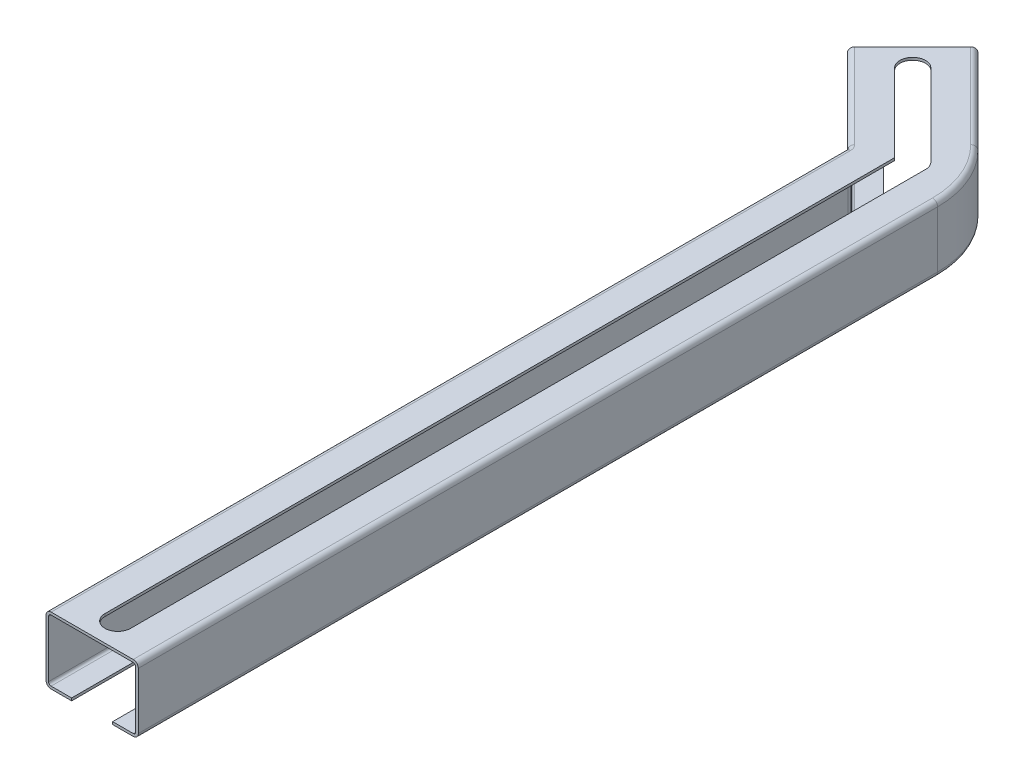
ISO-10303-21;
HEADER;
FILE_DESCRIPTION(('STEP AP214'),'2;1');
FILE_NAME('part.step','',(''),(''),'','','');
FILE_SCHEMA(('AUTOMOTIVE_DESIGN { 1 0 10303 214 1 1 1 1 }'));
ENDSEC;
DATA;
#1=APPLICATION_CONTEXT('core data for automotive mechanical design processes');
#2=APPLICATION_PROTOCOL_DEFINITION('international standard','automotive_design',2000,#1);
#3=PRODUCT_CONTEXT('',#1,'mechanical');
#4=PRODUCT('Part','Part','',(#3));
#5=PRODUCT_RELATED_PRODUCT_CATEGORY('part','',(#4));
#6=PRODUCT_DEFINITION_FORMATION('','',#4);
#7=PRODUCT_DEFINITION_CONTEXT('part definition',#1,'design');
#8=PRODUCT_DEFINITION('design','',#6,#7);
#9=PRODUCT_DEFINITION_SHAPE('','',#8);
#10=(LENGTH_UNIT() NAMED_UNIT(*) SI_UNIT(.MILLI.,.METRE.));
#11=(NAMED_UNIT(*) PLANE_ANGLE_UNIT() SI_UNIT($,.RADIAN.));
#12=(NAMED_UNIT(*) SI_UNIT($,.STERADIAN.) SOLID_ANGLE_UNIT());
#13=UNCERTAINTY_MEASURE_WITH_UNIT(LENGTH_MEASURE(1.E-05),#10,'distance_accuracy_value','');
#14=(GEOMETRIC_REPRESENTATION_CONTEXT(3) GLOBAL_UNCERTAINTY_ASSIGNED_CONTEXT((#13)) GLOBAL_UNIT_ASSIGNED_CONTEXT((#10,
#11,#12)) REPRESENTATION_CONTEXT('',''));
#15=CARTESIAN_POINT('',(0.,0.,0.));
#16=DIRECTION('',(0.,0.,1.));
#17=DIRECTION('',(1.,0.,0.));
#18=AXIS2_PLACEMENT_3D('',#15,#16,#17);
#19=CARTESIAN_POINT('',(-38.8908729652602,0.,-348.89087296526));
#20=DIRECTION('',(0.707106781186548,0.,0.707106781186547));
#21=DIRECTION('',(0.,-1.,0.));
#22=AXIS2_PLACEMENT_3D('',#19,#20,#21);
#23=PLANE('',#22);
#24=DIRECTION('',(-0.707106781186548,0.,0.707106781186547));
#25=VECTOR('',#24,1.);
#26=CARTESIAN_POINT('',(-27.5771644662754,0.,-360.204581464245));
#27=LINE('',#26,#25);
#28=CARTESIAN_POINT('',(-27.5771644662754,0.,-360.204581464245));
#29=VERTEX_POINT('',#28);
#30=CARTESIAN_POINT('',(-33.2340187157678,0.,-354.547727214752));
#31=VERTEX_POINT('',#30);
#32=EDGE_CURVE('E378',#29,#31,#27,.T.);
#33=ORIENTED_EDGE('',*,*,#32,.F.);
#34=CARTESIAN_POINT('',(-27.5771644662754,1.00000000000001,-360.204581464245));
#35=DIRECTION('',(-0.707106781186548,0.,-0.707106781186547));
#36=DIRECTION('',(0.,1.,0.));
#37=AXIS2_PLACEMENT_3D('',#34,#35,#36);
#38=CIRCLE('',#37,1.);
#39=CARTESIAN_POINT('',(-26.8700576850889,1.,-360.911688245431));
#40=VERTEX_POINT('',#39);
#41=EDGE_CURVE('E257',#40,#29,#38,.T.);
#42=ORIENTED_EDGE('',*,*,#41,.F.);
#43=DIRECTION('',(0.,-1.,0.));
#44=VECTOR('',#43,1.);
#45=CARTESIAN_POINT('',(-26.8700576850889,23.,-360.911688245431));
#46=LINE('',#45,#44);
#47=CARTESIAN_POINT('',(-26.8700576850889,23.,-360.911688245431));
#48=VERTEX_POINT('',#47);
#49=EDGE_CURVE('E251',#48,#40,#46,.T.);
#50=ORIENTED_EDGE('',*,*,#49,.F.);
#51=CARTESIAN_POINT('',(-27.5771644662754,23.,-360.204581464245));
#52=DIRECTION('',(-0.707106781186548,0.,-0.707106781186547));
#53=DIRECTION('',(-0.707106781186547,0.,0.707106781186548));
#54=AXIS2_PLACEMENT_3D('',#51,#52,#53);
#55=CIRCLE('',#54,1.);
#56=CARTESIAN_POINT('',(-27.5771644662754,24.,-360.204581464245));
#57=VERTEX_POINT('',#56);
#58=EDGE_CURVE('E242',#57,#48,#55,.T.);
#59=ORIENTED_EDGE('',*,*,#58,.F.);
#60=DIRECTION('',(0.707106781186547,0.,-0.707106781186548));
#61=VECTOR('',#60,1.);
#62=CARTESIAN_POINT('',(-50.2045814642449,24.,-337.577164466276));
#63=LINE('',#62,#61);
#64=CARTESIAN_POINT('',(-50.2045814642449,24.,-337.577164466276));
#65=VERTEX_POINT('',#64);
#66=EDGE_CURVE('E9',#65,#57,#63,.T.);
#67=ORIENTED_EDGE('',*,*,#66,.F.);
#68=CARTESIAN_POINT('',(-50.204581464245,23.,-337.577164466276));
#69=DIRECTION('',(-0.707106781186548,0.,-0.707106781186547));
#70=DIRECTION('',(0.,-1.,0.));
#71=AXIS2_PLACEMENT_3D('',#68,#69,#70);
#72=CIRCLE('',#71,1.);
#73=CARTESIAN_POINT('',(-50.9116882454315,23.,-336.870057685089));
#74=VERTEX_POINT('',#73);
#75=EDGE_CURVE('E233',#74,#65,#72,.T.);
#76=ORIENTED_EDGE('',*,*,#75,.F.);
#77=DIRECTION('',(0.,1.,0.));
#78=VECTOR('',#77,1.);
#79=CARTESIAN_POINT('',(-50.9116882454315,1.,-336.870057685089));
#80=LINE('',#79,#78);
#81=CARTESIAN_POINT('',(-50.9116882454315,1.,-336.870057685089));
#82=VERTEX_POINT('',#81);
#83=EDGE_CURVE('E228',#82,#74,#80,.T.);
#84=ORIENTED_EDGE('',*,*,#83,.F.);
#85=CARTESIAN_POINT('',(-50.204581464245,1.,-337.577164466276));
#86=DIRECTION('',(-0.707106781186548,0.,-0.707106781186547));
#87=DIRECTION('',(0.707106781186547,0.,-0.707106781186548));
#88=AXIS2_PLACEMENT_3D('',#85,#86,#87);
#89=CIRCLE('',#88,1.);
#90=CARTESIAN_POINT('',(-50.2045814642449,0.,-337.577164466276));
#91=VERTEX_POINT('',#90);
#92=EDGE_CURVE('E218',#91,#82,#89,.T.);
#93=ORIENTED_EDGE('',*,*,#92,.F.);
#94=DIRECTION('',(-0.707106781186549,0.,0.707106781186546));
#95=VECTOR('',#94,1.);
#96=CARTESIAN_POINT('',(-44.5477272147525,0.,-343.234018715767));
#97=LINE('',#96,#95);
#98=CARTESIAN_POINT('',(-44.5477272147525,0.,-343.234018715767));
#99=VERTEX_POINT('',#98);
#100=EDGE_CURVE('E414',#99,#91,#97,.T.);
#101=ORIENTED_EDGE('',*,*,#100,.F.);
#102=DIRECTION('',(0.,1.,0.));
#103=VECTOR('',#102,1.);
#104=CARTESIAN_POINT('',(-44.5477272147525,-1.,-343.234018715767));
#105=LINE('',#104,#103);
#106=CARTESIAN_POINT('',(-44.5477272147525,-1.,-343.234018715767));
#107=VERTEX_POINT('',#106);
#108=EDGE_CURVE('E914',#107,#99,#105,.T.);
#109=ORIENTED_EDGE('',*,*,#108,.F.);
#110=DIRECTION('',(0.707106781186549,0.,-0.707106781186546));
#111=VECTOR('',#110,1.);
#112=CARTESIAN_POINT('',(-50.2045814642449,-1.,-337.577164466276));
#113=LINE('',#112,#111);
#114=CARTESIAN_POINT('',(-50.2045814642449,-1.,-337.577164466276));
#115=VERTEX_POINT('',#114);
#116=EDGE_CURVE('E290',#115,#107,#113,.T.);
#117=ORIENTED_EDGE('',*,*,#116,.F.);
#118=CARTESIAN_POINT('',(-50.204581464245,1.,-337.577164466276));
#119=DIRECTION('',(0.707106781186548,0.,0.707106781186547));
#120=DIRECTION('',(-0.707106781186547,0.,0.707106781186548));
#121=AXIS2_PLACEMENT_3D('',#118,#119,#120);
#122=CIRCLE('',#121,2.);
#123=CARTESIAN_POINT('',(-51.618795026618,1.,-336.162950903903));
#124=VERTEX_POINT('',#123);
#125=EDGE_CURVE('E699',#124,#115,#122,.T.);
#126=ORIENTED_EDGE('',*,*,#125,.F.);
#127=DIRECTION('',(0.,-1.,0.));
#128=VECTOR('',#127,1.);
#129=CARTESIAN_POINT('',(-51.618795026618,23.,-336.162950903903));
#130=LINE('',#129,#128);
#131=CARTESIAN_POINT('',(-51.618795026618,23.,-336.162950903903));
#132=VERTEX_POINT('',#131);
#133=EDGE_CURVE('E765',#132,#124,#130,.T.);
#134=ORIENTED_EDGE('',*,*,#133,.F.);
#135=CARTESIAN_POINT('',(-50.204581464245,23.,-337.577164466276));
#136=DIRECTION('',(0.707106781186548,0.,0.707106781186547));
#137=DIRECTION('',(0.,1.,0.));
#138=AXIS2_PLACEMENT_3D('',#135,#136,#137);
#139=CIRCLE('',#138,2.);
#140=CARTESIAN_POINT('',(-50.2045814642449,25.,-337.577164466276));
#141=VERTEX_POINT('',#140);
#142=EDGE_CURVE('E749',#141,#132,#139,.T.);
#143=ORIENTED_EDGE('',*,*,#142,.F.);
#144=DIRECTION('',(-0.707106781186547,0.,0.707106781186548));
#145=VECTOR('',#144,1.);
#146=CARTESIAN_POINT('',(-27.5771644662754,25.,-360.204581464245));
#147=LINE('',#146,#145);
#148=CARTESIAN_POINT('',(-27.5771644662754,25.,-360.204581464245));
#149=VERTEX_POINT('',#148);
#150=EDGE_CURVE('E399',#149,#141,#147,.T.);
#151=ORIENTED_EDGE('',*,*,#150,.F.);
#152=CARTESIAN_POINT('',(-27.5771644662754,23.,-360.204581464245));
#153=DIRECTION('',(0.707106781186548,0.,0.707106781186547));
#154=DIRECTION('',(0.707106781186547,0.,-0.707106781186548));
#155=AXIS2_PLACEMENT_3D('',#152,#153,#154);
#156=CIRCLE('',#155,2.);
#157=CARTESIAN_POINT('',(-26.1629509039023,23.,-361.618795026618));
#158=VERTEX_POINT('',#157);
#159=EDGE_CURVE('E735',#158,#149,#156,.T.);
#160=ORIENTED_EDGE('',*,*,#159,.F.);
#161=DIRECTION('',(0.,1.,0.));
#162=VECTOR('',#161,1.);
#163=CARTESIAN_POINT('',(-26.1629509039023,1.,-361.618795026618));
#164=LINE('',#163,#162);
#165=CARTESIAN_POINT('',(-26.1629509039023,1.,-361.618795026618));
#166=VERTEX_POINT('',#165);
#167=EDGE_CURVE('E656',#166,#158,#164,.T.);
#168=ORIENTED_EDGE('',*,*,#167,.F.);
#169=CARTESIAN_POINT('',(-27.5771644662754,1.,-360.204581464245));
#170=DIRECTION('',(0.707106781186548,0.,0.707106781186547));
#171=DIRECTION('',(0.,-1.,0.));
#172=AXIS2_PLACEMENT_3D('',#169,#170,#171);
#173=CIRCLE('',#172,2.);
#174=CARTESIAN_POINT('',(-27.5771644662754,-1.,-360.204581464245));
#175=VERTEX_POINT('',#174);
#176=EDGE_CURVE('E681',#175,#166,#173,.T.);
#177=ORIENTED_EDGE('',*,*,#176,.F.);
#178=DIRECTION('',(0.707106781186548,0.,-0.707106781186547));
#179=VECTOR('',#178,1.);
#180=CARTESIAN_POINT('',(-33.2340187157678,-1.,-354.547727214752));
#181=LINE('',#180,#179);
#182=CARTESIAN_POINT('',(-33.2340187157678,-1.,-354.547727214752));
#183=VERTEX_POINT('',#182);
#184=EDGE_CURVE('E382',#183,#175,#181,.T.);
#185=ORIENTED_EDGE('',*,*,#184,.F.);
#186=DIRECTION('',(0.,-1.,0.));
#187=VECTOR('',#186,1.);
#188=CARTESIAN_POINT('',(-33.2340187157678,0.,-354.547727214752));
#189=LINE('',#188,#187);
#190=EDGE_CURVE('E647',#31,#183,#189,.T.);
#191=ORIENTED_EDGE('',*,*,#190,.F.);
#192=EDGE_LOOP('',(#33,#42,#50,#59,#67,#76,#84,#93,#101,#109,#117,#126,#134,#143,#151,#160,#168,
#177,#185,#191));
#193=FACE_BOUND('',#192,.T.);
#194=ADVANCED_FACE('F15',(#193),#23,.F.);
#195=CARTESIAN_POINT('',(16.,23.,0.));
#196=DIRECTION('',(0.,0.,-1.));
#197=DIRECTION('',(-1.,0.,0.));
#198=AXIS2_PLACEMENT_3D('',#195,#196,#197);
#199=CYLINDRICAL_SURFACE('',#198,1.);
#200=CARTESIAN_POINT('',(16.,23.,-301.715728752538));
#201=DIRECTION('',(0.,0.,-1.));
#202=DIRECTION('',(-1.,0.,0.));
#203=AXIS2_PLACEMENT_3D('',#200,#201,#202);
#204=CIRCLE('',#203,1.);
#205=CARTESIAN_POINT('',(16.,24.,-301.715728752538));
#206=VERTEX_POINT('',#205);
#207=CARTESIAN_POINT('',(17.,23.,-301.715728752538));
#208=VERTEX_POINT('',#207);
#209=EDGE_CURVE('E363',#206,#208,#204,.T.);
#210=ORIENTED_EDGE('',*,*,#209,.T.);
#211=DIRECTION('',(0.,0.,1.));
#212=VECTOR('',#211,1.);
#213=CARTESIAN_POINT('',(17.,23.,-301.715728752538));
#214=LINE('',#213,#212);
#215=CARTESIAN_POINT('',(17.,23.,10.));
#216=VERTEX_POINT('',#215);
#217=EDGE_CURVE('E47',#208,#216,#214,.T.);
#218=ORIENTED_EDGE('',*,*,#217,.T.);
#219=CARTESIAN_POINT('',(16.,23.,10.));
#220=DIRECTION('',(0.,0.,1.));
#221=DIRECTION('',(-1.,0.,0.));
#222=AXIS2_PLACEMENT_3D('',#219,#220,#221);
#223=CIRCLE('',#222,1.);
#224=CARTESIAN_POINT('',(16.,24.,10.));
#225=VERTEX_POINT('',#224);
#226=EDGE_CURVE('E1254',#216,#225,#223,.T.);
#227=ORIENTED_EDGE('',*,*,#226,.T.);
#228=DIRECTION('',(0.,0.,-1.));
#229=VECTOR('',#228,1.);
#230=CARTESIAN_POINT('',(16.,24.,10.));
#231=LINE('',#230,#229);
#232=EDGE_CURVE('E23',#225,#206,#231,.T.);
#233=ORIENTED_EDGE('',*,*,#232,.T.);
#234=EDGE_LOOP('',(#210,#218,#227,#233));
#235=FACE_BOUND('',#234,.T.);
#236=ADVANCED_FACE('F1372',(#235),#199,.F.);
#237=CARTESIAN_POINT('',(-16.,24.,0.));
#238=DIRECTION('',(0.,-1.,0.));
#239=DIRECTION('',(0.,0.,-1.));
#240=AXIS2_PLACEMENT_3D('',#237,#238,#239);
#241=PLANE('',#240);
#242=DIRECTION('',(0.,0.,-1.));
#243=VECTOR('',#242,1.);
#244=CARTESIAN_POINT('',(5.,24.,0.));
#245=LINE('',#244,#243);
#246=CARTESIAN_POINT('',(5.,24.,0.));
#247=VERTEX_POINT('',#246);
#248=CARTESIAN_POINT('',(5.,24.,-310.));
#249=VERTEX_POINT('',#248);
#250=EDGE_CURVE('E1167',#247,#249,#245,.T.);
#251=ORIENTED_EDGE('',*,*,#250,.T.);
#252=CARTESIAN_POINT('',(0.,24.,-310.));
#253=DIRECTION('',(0.,1.,0.));
#254=DIRECTION('',(1.,0.,0.));
#255=AXIS2_PLACEMENT_3D('',#252,#253,#254);
#256=CIRCLE('',#255,5.);
#257=CARTESIAN_POINT('',(3.53553390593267,24.,-313.535533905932));
#258=VERTEX_POINT('',#257);
#259=EDGE_CURVE('E1220',#249,#258,#256,.T.);
#260=ORIENTED_EDGE('',*,*,#259,.T.);
#261=DIRECTION('',(-0.707106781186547,0.,-0.707106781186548));
#262=VECTOR('',#261,1.);
#263=CARTESIAN_POINT('',(3.53553390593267,24.,-313.535533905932));
#264=LINE('',#263,#262);
#265=CARTESIAN_POINT('',(-28.2842712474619,24.,-345.355339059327));
#266=VERTEX_POINT('',#265);
#267=EDGE_CURVE('E1210',#258,#266,#264,.T.);
#268=ORIENTED_EDGE('',*,*,#267,.T.);
#269=CARTESIAN_POINT('',(-31.8198051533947,24.,-341.819805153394));
#270=DIRECTION('',(0.,1.,0.));
#271=DIRECTION('',(0.707106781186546,0.,-0.707106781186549));
#272=AXIS2_PLACEMENT_3D('',#269,#270,#271);
#273=CIRCLE('',#272,5.);
#274=CARTESIAN_POINT('',(-35.3553390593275,24.,-338.284271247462));
#275=VERTEX_POINT('',#274);
#276=EDGE_CURVE('E1236',#266,#275,#273,.T.);
#277=ORIENTED_EDGE('',*,*,#276,.T.);
#278=DIRECTION('',(0.707106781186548,0.,0.707106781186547));
#279=VECTOR('',#278,1.);
#280=CARTESIAN_POINT('',(-35.3553390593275,24.,-338.284271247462));
#281=LINE('',#280,#279);
#282=CARTESIAN_POINT('',(-5.00000000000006,24.,-307.928932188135));
#283=VERTEX_POINT('',#282);
#284=EDGE_CURVE('E1334',#275,#283,#281,.T.);
#285=ORIENTED_EDGE('',*,*,#284,.T.);
#286=DIRECTION('',(0.,0.,1.));
#287=VECTOR('',#286,1.);
#288=CARTESIAN_POINT('',(-5.00000000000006,24.,-307.928932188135));
#289=LINE('',#288,#287);
#290=CARTESIAN_POINT('',(-5.,24.,0.));
#291=VERTEX_POINT('',#290);
#292=EDGE_CURVE('E1193',#283,#291,#289,.T.);
#293=ORIENTED_EDGE('',*,*,#292,.T.);
#294=CARTESIAN_POINT('',(0.,24.,0.));
#295=DIRECTION('',(0.,1.,0.));
#296=DIRECTION('',(-1.,0.,0.));
#297=AXIS2_PLACEMENT_3D('',#294,#295,#296);
#298=CIRCLE('',#297,5.);
#299=EDGE_CURVE('E1184',#291,#247,#298,.T.);
#300=ORIENTED_EDGE('',*,*,#299,.T.);
#301=EDGE_LOOP('',(#251,#260,#268,#277,#285,#293,#300));
#302=FACE_BOUND('',#301,.T.);
#303=ORIENTED_EDGE('',*,*,#232,.F.);
#304=DIRECTION('',(-1.,0.,0.));
#305=VECTOR('',#304,1.);
#306=CARTESIAN_POINT('',(16.,24.,10.));
#307=LINE('',#306,#305);
#308=CARTESIAN_POINT('',(-16.,24.,10.));
#309=VERTEX_POINT('',#308);
#310=EDGE_CURVE('E1251',#225,#309,#307,.T.);
#311=ORIENTED_EDGE('',*,*,#310,.T.);
#312=DIRECTION('',(0.,0.,1.));
#313=VECTOR('',#312,1.);
#314=CARTESIAN_POINT('',(-16.,24.,-301.715728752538));
#315=LINE('',#314,#313);
#316=CARTESIAN_POINT('',(-16.,24.,-301.715728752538));
#317=VERTEX_POINT('',#316);
#318=EDGE_CURVE('E169',#317,#309,#315,.T.);
#319=ORIENTED_EDGE('',*,*,#318,.F.);
#320=CARTESIAN_POINT('',(-20.,24.,-301.715728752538));
#321=DIRECTION('',(0.,1.,0.));
#322=DIRECTION('',(1.,0.,0.));
#323=AXIS2_PLACEMENT_3D('',#320,#321,#322);
#324=CIRCLE('',#323,4.);
#325=CARTESIAN_POINT('',(-17.1715728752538,24.,-304.544155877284));
#326=VERTEX_POINT('',#325);
#327=EDGE_CURVE('E178',#317,#326,#324,.T.);
#328=ORIENTED_EDGE('',*,*,#327,.T.);
#329=DIRECTION('',(-0.707106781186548,0.,-0.707106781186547));
#330=VECTOR('',#329,1.);
#331=CARTESIAN_POINT('',(-17.1715728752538,24.,-304.544155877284));
#332=LINE('',#331,#330);
#333=EDGE_CURVE('E237',#326,#65,#332,.T.);
#334=ORIENTED_EDGE('',*,*,#333,.T.);
#335=ORIENTED_EDGE('',*,*,#66,.T.);
#336=DIRECTION('',(-0.707106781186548,0.,-0.707106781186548));
#337=VECTOR('',#336,1.);
#338=CARTESIAN_POINT('',(5.45584412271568,24.,-327.171572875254));
#339=LINE('',#338,#337);
#340=CARTESIAN_POINT('',(5.45584412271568,24.,-327.171572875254));
#341=VERTEX_POINT('',#340);
#342=EDGE_CURVE('E256',#341,#57,#339,.T.);
#343=ORIENTED_EDGE('',*,*,#342,.F.);
#344=CARTESIAN_POINT('',(-20.,24.,-301.715728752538));
#345=DIRECTION('',(0.,1.,0.));
#346=DIRECTION('',(1.,0.,0.));
#347=AXIS2_PLACEMENT_3D('',#344,#345,#346);
#348=CIRCLE('',#347,36.);
#349=EDGE_CURVE('E359',#206,#341,#348,.T.);
#350=ORIENTED_EDGE('',*,*,#349,.F.);
#351=EDGE_LOOP('',(#303,#311,#319,#328,#334,#335,#343,#350));
#352=FACE_BOUND('',#351,.T.);
#353=ADVANCED_FACE('F1190',(#302,#352),#241,.T.);
#354=CARTESIAN_POINT('',(-16.,23.,0.));
#355=DIRECTION('',(0.,0.,-1.));
#356=DIRECTION('',(0.,-1.,0.));
#357=AXIS2_PLACEMENT_3D('',#354,#355,#356);
#358=CYLINDRICAL_SURFACE('',#357,1.);
#359=CARTESIAN_POINT('',(-16.,23.,-301.715728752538));
#360=DIRECTION('',(0.,0.,-1.));
#361=DIRECTION('',(0.,-1.,0.));
#362=AXIS2_PLACEMENT_3D('',#359,#360,#361);
#363=CIRCLE('',#362,1.);
#364=CARTESIAN_POINT('',(-17.,23.,-301.715728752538));
#365=VERTEX_POINT('',#364);
#366=EDGE_CURVE('E159',#365,#317,#363,.T.);
#367=ORIENTED_EDGE('',*,*,#366,.T.);
#368=ORIENTED_EDGE('',*,*,#318,.T.);
#369=CARTESIAN_POINT('',(-16.,23.,10.));
#370=DIRECTION('',(0.,0.,1.));
#371=DIRECTION('',(0.,-1.,0.));
#372=AXIS2_PLACEMENT_3D('',#369,#370,#371);
#373=CIRCLE('',#372,1.);
#374=CARTESIAN_POINT('',(-17.,23.,10.));
#375=VERTEX_POINT('',#374);
#376=EDGE_CURVE('E163',#309,#375,#373,.T.);
#377=ORIENTED_EDGE('',*,*,#376,.T.);
#378=DIRECTION('',(0.,0.,1.));
#379=VECTOR('',#378,1.);
#380=CARTESIAN_POINT('',(-17.,23.,-301.715728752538));
#381=LINE('',#380,#379);
#382=EDGE_CURVE('E155',#365,#375,#381,.T.);
#383=ORIENTED_EDGE('',*,*,#382,.F.);
#384=EDGE_LOOP('',(#367,#368,#377,#383));
#385=FACE_BOUND('',#384,.T.);
#386=ADVANCED_FACE('F157',(#385),#358,.F.);
#387=CARTESIAN_POINT('',(-17.,1.,0.));
#388=DIRECTION('',(1.,0.,0.));
#389=DIRECTION('',(0.,1.,0.));
#390=AXIS2_PLACEMENT_3D('',#387,#388,#389);
#391=PLANE('',#390);
#392=DIRECTION('',(0.,1.,0.));
#393=VECTOR('',#392,1.);
#394=CARTESIAN_POINT('',(-17.,1.,-301.715728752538));
#395=LINE('',#394,#393);
#396=CARTESIAN_POINT('',(-17.,1.,-301.715728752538));
#397=VERTEX_POINT('',#396);
#398=EDGE_CURVE('E184',#397,#365,#395,.T.);
#399=ORIENTED_EDGE('',*,*,#398,.T.);
#400=ORIENTED_EDGE('',*,*,#382,.T.);
#401=DIRECTION('',(0.,-1.,0.));
#402=VECTOR('',#401,1.);
#403=CARTESIAN_POINT('',(-17.,23.,10.));
#404=LINE('',#403,#402);
#405=CARTESIAN_POINT('',(-17.,1.,10.));
#406=VERTEX_POINT('',#405);
#407=EDGE_CURVE('E578',#375,#406,#404,.T.);
#408=ORIENTED_EDGE('',*,*,#407,.T.);
#409=DIRECTION('',(0.,0.,1.));
#410=VECTOR('',#409,1.);
#411=CARTESIAN_POINT('',(-17.,1.,-301.715728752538));
#412=LINE('',#411,#410);
#413=EDGE_CURVE('E170',#397,#406,#412,.T.);
#414=ORIENTED_EDGE('',*,*,#413,.F.);
#415=EDGE_LOOP('',(#399,#400,#408,#414));
#416=FACE_BOUND('',#415,.T.);
#417=ADVANCED_FACE('F185',(#416),#391,.T.);
#418=CARTESIAN_POINT('',(-16.,1.,0.));
#419=DIRECTION('',(0.,0.,-1.));
#420=DIRECTION('',(1.,0.,0.));
#421=AXIS2_PLACEMENT_3D('',#418,#419,#420);
#422=CYLINDRICAL_SURFACE('',#421,1.);
#423=CARTESIAN_POINT('',(-16.,1.,-301.715728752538));
#424=DIRECTION('',(0.,0.,-1.));
#425=DIRECTION('',(1.,0.,0.));
#426=AXIS2_PLACEMENT_3D('',#423,#424,#425);
#427=CIRCLE('',#426,1.);
#428=CARTESIAN_POINT('',(-16.,0.,-301.715728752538));
#429=VERTEX_POINT('',#428);
#430=EDGE_CURVE('E204',#429,#397,#427,.T.);
#431=ORIENTED_EDGE('',*,*,#430,.T.);
#432=ORIENTED_EDGE('',*,*,#413,.T.);
#433=CARTESIAN_POINT('',(-16.,1.,10.));
#434=DIRECTION('',(0.,0.,1.));
#435=DIRECTION('',(1.,0.,0.));
#436=AXIS2_PLACEMENT_3D('',#433,#434,#435);
#437=CIRCLE('',#436,1.);
#438=CARTESIAN_POINT('',(-16.,0.,10.));
#439=VERTEX_POINT('',#438);
#440=EDGE_CURVE('E573',#406,#439,#437,.T.);
#441=ORIENTED_EDGE('',*,*,#440,.T.);
#442=DIRECTION('',(0.,0.,1.));
#443=VECTOR('',#442,1.);
#444=CARTESIAN_POINT('',(-16.,0.,-301.715728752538));
#445=LINE('',#444,#443);
#446=EDGE_CURVE('E289',#429,#439,#445,.T.);
#447=ORIENTED_EDGE('',*,*,#446,.F.);
#448=EDGE_LOOP('',(#431,#432,#441,#447));
#449=FACE_BOUND('',#448,.T.);
#450=ADVANCED_FACE('F1528',(#449),#422,.F.);
#451=CARTESIAN_POINT('',(-8.,0.,0.));
#452=DIRECTION('',(0.,1.,0.));
#453=DIRECTION('',(1.,0.,0.));
#454=AXIS2_PLACEMENT_3D('',#451,#452,#453);
#455=PLANE('',#454);
#456=ORIENTED_EDGE('',*,*,#446,.T.);
#457=DIRECTION('',(1.,0.,0.));
#458=VECTOR('',#457,1.);
#459=CARTESIAN_POINT('',(-16.,0.,10.));
#460=LINE('',#459,#458);
#461=CARTESIAN_POINT('',(-8.,0.,10.));
#462=VERTEX_POINT('',#461);
#463=EDGE_CURVE('E579',#439,#462,#460,.T.);
#464=ORIENTED_EDGE('',*,*,#463,.T.);
#465=DIRECTION('',(0.,0.,1.));
#466=VECTOR('',#465,1.);
#467=CARTESIAN_POINT('',(-8.,0.,-301.715728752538));
#468=LINE('',#467,#466);
#469=CARTESIAN_POINT('',(-8.,0.,-301.715728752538));
#470=VERTEX_POINT('',#469);
#471=EDGE_CURVE('E285',#470,#462,#468,.T.);
#472=ORIENTED_EDGE('',*,*,#471,.F.);
#473=CARTESIAN_POINT('',(-20.,0.,-301.715728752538));
#474=DIRECTION('',(0.,1.,0.));
#475=DIRECTION('',(1.,0.,0.));
#476=AXIS2_PLACEMENT_3D('',#473,#474,#475);
#477=CIRCLE('',#476,12.);
#478=CARTESIAN_POINT('',(-11.5147186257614,0.,-310.201010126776));
#479=VERTEX_POINT('',#478);
#480=EDGE_CURVE('E300',#470,#479,#477,.T.);
#481=ORIENTED_EDGE('',*,*,#480,.T.);
#482=DIRECTION('',(-0.707106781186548,0.,-0.707106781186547));
#483=VECTOR('',#482,1.);
#484=CARTESIAN_POINT('',(-11.5147186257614,0.,-310.201010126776));
#485=LINE('',#484,#483);
#486=EDGE_CURVE('E208',#479,#99,#485,.T.);
#487=ORIENTED_EDGE('',*,*,#486,.T.);
#488=ORIENTED_EDGE('',*,*,#100,.T.);
#489=DIRECTION('',(-0.707106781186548,0.,-0.707106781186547));
#490=VECTOR('',#489,1.);
#491=CARTESIAN_POINT('',(-17.1715728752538,0.,-304.544155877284));
#492=LINE('',#491,#490);
#493=CARTESIAN_POINT('',(-17.1715728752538,0.,-304.544155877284));
#494=VERTEX_POINT('',#493);
#495=EDGE_CURVE('E223',#494,#91,#492,.T.);
#496=ORIENTED_EDGE('',*,*,#495,.F.);
#497=CARTESIAN_POINT('',(-20.,0.,-301.715728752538));
#498=DIRECTION('',(0.,1.,0.));
#499=DIRECTION('',(1.,0.,0.));
#500=AXIS2_PLACEMENT_3D('',#497,#498,#499);
#501=CIRCLE('',#500,4.);
#502=EDGE_CURVE('E198',#429,#494,#501,.T.);
#503=ORIENTED_EDGE('',*,*,#502,.F.);
#504=EDGE_LOOP('',(#456,#464,#472,#481,#487,#488,#496,#503));
#505=FACE_BOUND('',#504,.T.);
#506=ADVANCED_FACE('F928',(#505),#455,.T.);
#507=CARTESIAN_POINT('',(-8.,-1.,0.));
#508=DIRECTION('',(1.,0.,0.));
#509=DIRECTION('',(0.,1.,0.));
#510=AXIS2_PLACEMENT_3D('',#507,#508,#509);
#511=PLANE('',#510);
#512=DIRECTION('',(0.,1.,0.));
#513=VECTOR('',#512,1.);
#514=CARTESIAN_POINT('',(-8.,-1.,-301.715728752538));
#515=LINE('',#514,#513);
#516=CARTESIAN_POINT('',(-8.,-1.,-301.715728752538));
#517=VERTEX_POINT('',#516);
#518=EDGE_CURVE('E295',#517,#470,#515,.T.);
#519=ORIENTED_EDGE('',*,*,#518,.T.);
#520=ORIENTED_EDGE('',*,*,#471,.T.);
#521=DIRECTION('',(0.,-1.,0.));
#522=VECTOR('',#521,1.);
#523=CARTESIAN_POINT('',(-8.,0.,10.));
#524=LINE('',#523,#522);
#525=CARTESIAN_POINT('',(-8.,-1.,10.));
#526=VERTEX_POINT('',#525);
#527=EDGE_CURVE('E603',#462,#526,#524,.T.);
#528=ORIENTED_EDGE('',*,*,#527,.T.);
#529=DIRECTION('',(0.,0.,1.));
#530=VECTOR('',#529,1.);
#531=CARTESIAN_POINT('',(-8.,-1.,-301.715728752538));
#532=LINE('',#531,#530);
#533=EDGE_CURVE('E352',#517,#526,#532,.T.);
#534=ORIENTED_EDGE('',*,*,#533,.F.);
#535=EDGE_LOOP('',(#519,#520,#528,#534));
#536=FACE_BOUND('',#535,.T.);
#537=ADVANCED_FACE('F1525',(#536),#511,.T.);
#538=CARTESIAN_POINT('',(-16.,-1.,0.));
#539=DIRECTION('',(0.,-1.,0.));
#540=DIRECTION('',(0.,0.,-1.));
#541=AXIS2_PLACEMENT_3D('',#538,#539,#540);
#542=PLANE('',#541);
#543=ORIENTED_EDGE('',*,*,#533,.T.);
#544=DIRECTION('',(-1.,0.,0.));
#545=VECTOR('',#544,1.);
#546=CARTESIAN_POINT('',(-8.,-1.,10.));
#547=LINE('',#546,#545);
#548=CARTESIAN_POINT('',(-16.,-1.,10.));
#549=VERTEX_POINT('',#548);
#550=EDGE_CURVE('E596',#526,#549,#547,.T.);
#551=ORIENTED_EDGE('',*,*,#550,.T.);
#552=DIRECTION('',(0.,0.,1.));
#553=VECTOR('',#552,1.);
#554=CARTESIAN_POINT('',(-16.,-1.,-301.715728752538));
#555=LINE('',#554,#553);
#556=CARTESIAN_POINT('',(-16.,-1.,-301.715728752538));
#557=VERTEX_POINT('',#556);
#558=EDGE_CURVE('E356',#557,#549,#555,.T.);
#559=ORIENTED_EDGE('',*,*,#558,.F.);
#560=CARTESIAN_POINT('',(-20.,-1.,-301.715728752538));
#561=DIRECTION('',(0.,1.,0.));
#562=DIRECTION('',(1.,0.,0.));
#563=AXIS2_PLACEMENT_3D('',#560,#561,#562);
#564=CIRCLE('',#563,4.);
#565=CARTESIAN_POINT('',(-17.1715728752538,-1.,-304.544155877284));
#566=VERTEX_POINT('',#565);
#567=EDGE_CURVE('E336',#557,#566,#564,.T.);
#568=ORIENTED_EDGE('',*,*,#567,.T.);
#569=DIRECTION('',(-0.707106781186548,0.,-0.707106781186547));
#570=VECTOR('',#569,1.);
#571=CARTESIAN_POINT('',(-17.1715728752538,-1.,-304.544155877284));
#572=LINE('',#571,#570);
#573=EDGE_CURVE('E704',#566,#115,#572,.T.);
#574=ORIENTED_EDGE('',*,*,#573,.T.);
#575=ORIENTED_EDGE('',*,*,#116,.T.);
#576=DIRECTION('',(-0.707106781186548,0.,-0.707106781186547));
#577=VECTOR('',#576,1.);
#578=CARTESIAN_POINT('',(-11.5147186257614,-1.,-310.201010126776));
#579=LINE('',#578,#577);
#580=CARTESIAN_POINT('',(-11.5147186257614,-1.,-310.201010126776));
#581=VERTEX_POINT('',#580);
#582=EDGE_CURVE('E214',#581,#107,#579,.T.);
#583=ORIENTED_EDGE('',*,*,#582,.F.);
#584=CARTESIAN_POINT('',(-20.,-1.,-301.715728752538));
#585=DIRECTION('',(0.,1.,0.));
#586=DIRECTION('',(1.,0.,0.));
#587=AXIS2_PLACEMENT_3D('',#584,#585,#586);
#588=CIRCLE('',#587,12.);
#589=EDGE_CURVE('E299',#517,#581,#588,.T.);
#590=ORIENTED_EDGE('',*,*,#589,.F.);
#591=EDGE_LOOP('',(#543,#551,#559,#568,#574,#575,#583,#590));
#592=FACE_BOUND('',#591,.T.);
#593=ADVANCED_FACE('F1521',(#592),#542,.T.);
#594=CARTESIAN_POINT('',(-16.,1.,0.));
#595=DIRECTION('',(0.,0.,-1.));
#596=DIRECTION('',(-1.,0.,0.));
#597=AXIS2_PLACEMENT_3D('',#594,#595,#596);
#598=CYLINDRICAL_SURFACE('',#597,2.);
#599=CARTESIAN_POINT('',(-16.,1.,-301.715728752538));
#600=DIRECTION('',(0.,0.,1.));
#601=DIRECTION('',(-1.,0.,0.));
#602=AXIS2_PLACEMENT_3D('',#599,#600,#601);
#603=CIRCLE('',#602,2.);
#604=CARTESIAN_POINT('',(-18.,1.,-301.715728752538));
#605=VERTEX_POINT('',#604);
#606=EDGE_CURVE('E340',#605,#557,#603,.T.);
#607=ORIENTED_EDGE('',*,*,#606,.T.);
#608=ORIENTED_EDGE('',*,*,#558,.T.);
#609=CARTESIAN_POINT('',(-16.,0.999999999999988,10.));
#610=DIRECTION('',(0.,0.,-1.));
#611=DIRECTION('',(-1.,0.,0.));
#612=AXIS2_PLACEMENT_3D('',#609,#610,#611);
#613=CIRCLE('',#612,2.);
#614=CARTESIAN_POINT('',(-18.,1.,10.));
#615=VERTEX_POINT('',#614);
#616=EDGE_CURVE('E589',#549,#615,#613,.T.);
#617=ORIENTED_EDGE('',*,*,#616,.T.);
#618=DIRECTION('',(0.,0.,1.));
#619=VECTOR('',#618,1.);
#620=CARTESIAN_POINT('',(-18.,1.,-301.715728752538));
#621=LINE('',#620,#619);
#622=EDGE_CURVE('E407',#605,#615,#621,.T.);
#623=ORIENTED_EDGE('',*,*,#622,.F.);
#624=EDGE_LOOP('',(#607,#608,#617,#623));
#625=FACE_BOUND('',#624,.T.);
#626=ADVANCED_FACE('F1518',(#625),#598,.T.);
#627=CARTESIAN_POINT('',(-18.,23.,0.));
#628=DIRECTION('',(-1.,0.,0.));
#629=DIRECTION('',(0.,0.,1.));
#630=AXIS2_PLACEMENT_3D('',#627,#628,#629);
#631=PLANE('',#630);
#632=DIRECTION('',(0.,-1.,0.));
#633=VECTOR('',#632,1.);
#634=CARTESIAN_POINT('',(-18.,23.,-301.715728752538));
#635=LINE('',#634,#633);
#636=CARTESIAN_POINT('',(-18.,23.,-301.715728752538));
#637=VERTEX_POINT('',#636);
#638=EDGE_CURVE('E331',#637,#605,#635,.T.);
#639=ORIENTED_EDGE('',*,*,#638,.T.);
#640=ORIENTED_EDGE('',*,*,#622,.T.);
#641=DIRECTION('',(0.,1.,0.));
#642=VECTOR('',#641,1.);
#643=CARTESIAN_POINT('',(-18.,1.,10.));
#644=LINE('',#643,#642);
#645=CARTESIAN_POINT('',(-18.,23.,10.));
#646=VERTEX_POINT('',#645);
#647=EDGE_CURVE('E584',#615,#646,#644,.T.);
#648=ORIENTED_EDGE('',*,*,#647,.T.);
#649=DIRECTION('',(0.,0.,1.));
#650=VECTOR('',#649,1.);
#651=CARTESIAN_POINT('',(-18.,23.,-301.715728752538));
#652=LINE('',#651,#650);
#653=EDGE_CURVE('E403',#637,#646,#652,.T.);
#654=ORIENTED_EDGE('',*,*,#653,.F.);
#655=EDGE_LOOP('',(#639,#640,#648,#654));
#656=FACE_BOUND('',#655,.T.);
#657=ADVANCED_FACE('F1515',(#656),#631,.T.);
#658=CARTESIAN_POINT('',(-16.,23.,0.));
#659=DIRECTION('',(0.,0.,-1.));
#660=DIRECTION('',(0.,1.,0.));
#661=AXIS2_PLACEMENT_3D('',#658,#659,#660);
#662=CYLINDRICAL_SURFACE('',#661,2.);
#663=CARTESIAN_POINT('',(-16.,23.,-301.715728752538));
#664=DIRECTION('',(0.,0.,1.));
#665=DIRECTION('',(0.,1.,0.));
#666=AXIS2_PLACEMENT_3D('',#663,#664,#665);
#667=CIRCLE('',#666,2.);
#668=CARTESIAN_POINT('',(-16.,25.,-301.715728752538));
#669=VERTEX_POINT('',#668);
#670=EDGE_CURVE('E326',#669,#637,#667,.T.);
#671=ORIENTED_EDGE('',*,*,#670,.T.);
#672=ORIENTED_EDGE('',*,*,#653,.T.);
#673=CARTESIAN_POINT('',(-16.,23.,10.));
#674=DIRECTION('',(0.,0.,-1.));
#675=DIRECTION('',(0.,1.,0.));
#676=AXIS2_PLACEMENT_3D('',#673,#674,#675);
#677=CIRCLE('',#676,2.);
#678=CARTESIAN_POINT('',(-16.,25.,10.));
#679=VERTEX_POINT('',#678);
#680=EDGE_CURVE('E569',#646,#679,#677,.T.);
#681=ORIENTED_EDGE('',*,*,#680,.T.);
#682=DIRECTION('',(0.,0.,1.));
#683=VECTOR('',#682,1.);
#684=CARTESIAN_POINT('',(-16.,25.,-301.715728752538));
#685=LINE('',#684,#683);
#686=EDGE_CURVE('E395',#669,#679,#685,.T.);
#687=ORIENTED_EDGE('',*,*,#686,.F.);
#688=EDGE_LOOP('',(#671,#672,#681,#687));
#689=FACE_BOUND('',#688,.T.);
#690=ADVANCED_FACE('F1287',(#689),#662,.T.);
#691=CARTESIAN_POINT('',(16.,25.,0.));
#692=DIRECTION('',(0.,1.,0.));
#693=DIRECTION('',(1.,0.,0.));
#694=AXIS2_PLACEMENT_3D('',#691,#692,#693);
#695=PLANE('',#694);
#696=DIRECTION('',(0.,0.,1.));
#697=VECTOR('',#696,1.);
#698=CARTESIAN_POINT('',(5.,25.,-310.));
#699=LINE('',#698,#697);
#700=CARTESIAN_POINT('',(5.,25.,-310.));
#701=VERTEX_POINT('',#700);
#702=CARTESIAN_POINT('',(5.,25.,0.));
#703=VERTEX_POINT('',#702);
#704=EDGE_CURVE('E1179',#701,#703,#699,.T.);
#705=ORIENTED_EDGE('',*,*,#704,.T.);
#706=CARTESIAN_POINT('',(0.,25.,0.));
#707=DIRECTION('',(0.,-1.,0.));
#708=DIRECTION('',(-1.,0.,0.));
#709=AXIS2_PLACEMENT_3D('',#706,#707,#708);
#710=CIRCLE('',#709,5.);
#711=CARTESIAN_POINT('',(-5.,25.,0.));
#712=VERTEX_POINT('',#711);
#713=EDGE_CURVE('E1186',#703,#712,#710,.T.);
#714=ORIENTED_EDGE('',*,*,#713,.T.);
#715=DIRECTION('',(0.,0.,-1.));
#716=VECTOR('',#715,1.);
#717=CARTESIAN_POINT('',(-5.,25.,0.));
#718=LINE('',#717,#716);
#719=CARTESIAN_POINT('',(-5.00000000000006,25.,-307.928932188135));
#720=VERTEX_POINT('',#719);
#721=EDGE_CURVE('E1202',#712,#720,#718,.T.);
#722=ORIENTED_EDGE('',*,*,#721,.T.);
#723=DIRECTION('',(-0.707106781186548,0.,-0.707106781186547));
#724=VECTOR('',#723,1.);
#725=CARTESIAN_POINT('',(-5.00000000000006,25.,-307.928932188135));
#726=LINE('',#725,#724);
#727=CARTESIAN_POINT('',(-35.3553390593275,25.,-338.284271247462));
#728=VERTEX_POINT('',#727);
#729=EDGE_CURVE('E1311',#720,#728,#726,.T.);
#730=ORIENTED_EDGE('',*,*,#729,.T.);
#731=CARTESIAN_POINT('',(-31.8198051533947,25.,-341.819805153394));
#732=DIRECTION('',(0.,-1.,0.));
#733=DIRECTION('',(0.707106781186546,0.,-0.707106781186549));
#734=AXIS2_PLACEMENT_3D('',#731,#732,#733);
#735=CIRCLE('',#734,5.);
#736=CARTESIAN_POINT('',(-28.2842712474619,25.,-345.355339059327));
#737=VERTEX_POINT('',#736);
#738=EDGE_CURVE('E1239',#728,#737,#735,.T.);
#739=ORIENTED_EDGE('',*,*,#738,.T.);
#740=DIRECTION('',(0.707106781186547,0.,0.707106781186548));
#741=VECTOR('',#740,1.);
#742=CARTESIAN_POINT('',(-28.2842712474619,25.,-345.355339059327));
#743=LINE('',#742,#741);
#744=CARTESIAN_POINT('',(3.53553390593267,25.,-313.535533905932));
#745=VERTEX_POINT('',#744);
#746=EDGE_CURVE('E1229',#737,#745,#743,.T.);
#747=ORIENTED_EDGE('',*,*,#746,.T.);
#748=CARTESIAN_POINT('',(0.,25.,-310.));
#749=DIRECTION('',(0.,-1.,0.));
#750=DIRECTION('',(1.,0.,0.));
#751=AXIS2_PLACEMENT_3D('',#748,#749,#750);
#752=CIRCLE('',#751,5.);
#753=EDGE_CURVE('E1211',#745,#701,#752,.T.);
#754=ORIENTED_EDGE('',*,*,#753,.T.);
#755=EDGE_LOOP('',(#705,#714,#722,#730,#739,#747,#754));
#756=FACE_BOUND('',#755,.T.);
#757=ORIENTED_EDGE('',*,*,#686,.T.);
#758=DIRECTION('',(1.,0.,0.));
#759=VECTOR('',#758,1.);
#760=CARTESIAN_POINT('',(-16.,25.,10.));
#761=LINE('',#760,#759);
#762=CARTESIAN_POINT('',(16.,25.,10.));
#763=VERTEX_POINT('',#762);
#764=EDGE_CURVE('E898',#679,#763,#761,.T.);
#765=ORIENTED_EDGE('',*,*,#764,.T.);
#766=DIRECTION('',(0.,0.,1.));
#767=VECTOR('',#766,1.);
#768=CARTESIAN_POINT('',(16.,25.,-301.715728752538));
#769=LINE('',#768,#767);
#770=CARTESIAN_POINT('',(16.,25.,-301.715728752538));
#771=VERTEX_POINT('',#770);
#772=EDGE_CURVE('E391',#771,#763,#769,.T.);
#773=ORIENTED_EDGE('',*,*,#772,.F.);
#774=CARTESIAN_POINT('',(-20.,25.,-301.715728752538));
#775=DIRECTION('',(0.,1.,0.));
#776=DIRECTION('',(1.,0.,0.));
#777=AXIS2_PLACEMENT_3D('',#774,#775,#776);
#778=CIRCLE('',#777,36.);
#779=CARTESIAN_POINT('',(5.45584412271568,25.,-327.171572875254));
#780=VERTEX_POINT('',#779);
#781=EDGE_CURVE('E322',#771,#780,#778,.T.);
#782=ORIENTED_EDGE('',*,*,#781,.T.);
#783=DIRECTION('',(-0.707106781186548,0.,-0.707106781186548));
#784=VECTOR('',#783,1.);
#785=CARTESIAN_POINT('',(5.45584412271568,25.,-327.171572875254));
#786=LINE('',#785,#784);
#787=EDGE_CURVE('E729',#780,#149,#786,.T.);
#788=ORIENTED_EDGE('',*,*,#787,.T.);
#789=ORIENTED_EDGE('',*,*,#150,.T.);
#790=DIRECTION('',(-0.707106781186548,0.,-0.707106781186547));
#791=VECTOR('',#790,1.);
#792=CARTESIAN_POINT('',(-17.1715728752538,25.,-304.544155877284));
#793=LINE('',#792,#791);
#794=CARTESIAN_POINT('',(-17.1715728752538,25.,-304.544155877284));
#795=VERTEX_POINT('',#794);
#796=EDGE_CURVE('E612',#795,#141,#793,.T.);
#797=ORIENTED_EDGE('',*,*,#796,.F.);
#798=CARTESIAN_POINT('',(-20.,25.,-301.715728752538));
#799=DIRECTION('',(0.,1.,0.));
#800=DIRECTION('',(1.,0.,0.));
#801=AXIS2_PLACEMENT_3D('',#798,#799,#800);
#802=CIRCLE('',#801,4.);
#803=EDGE_CURVE('E332',#669,#795,#802,.T.);
#804=ORIENTED_EDGE('',*,*,#803,.F.);
#805=EDGE_LOOP('',(#757,#765,#773,#782,#788,#789,#797,#804));
#806=FACE_BOUND('',#805,.T.);
#807=ADVANCED_FACE('F1274',(#756,#806),#695,.T.);
#808=CARTESIAN_POINT('',(16.,23.,0.));
#809=DIRECTION('',(0.,0.,-1.));
#810=DIRECTION('',(1.,0.,0.));
#811=AXIS2_PLACEMENT_3D('',#808,#809,#810);
#812=CYLINDRICAL_SURFACE('',#811,2.);
#813=CARTESIAN_POINT('',(16.,23.,-301.715728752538));
#814=DIRECTION('',(0.,0.,1.));
#815=DIRECTION('',(1.,0.,0.));
#816=AXIS2_PLACEMENT_3D('',#813,#814,#815);
#817=CIRCLE('',#816,2.);
#818=CARTESIAN_POINT('',(18.,23.,-301.715728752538));
#819=VERTEX_POINT('',#818);
#820=EDGE_CURVE('E317',#819,#771,#817,.T.);
#821=ORIENTED_EDGE('',*,*,#820,.T.);
#822=ORIENTED_EDGE('',*,*,#772,.T.);
#823=CARTESIAN_POINT('',(16.,23.,10.));
#824=DIRECTION('',(0.,0.,-1.));
#825=DIRECTION('',(1.,0.,0.));
#826=AXIS2_PLACEMENT_3D('',#823,#824,#825);
#827=CIRCLE('',#826,2.);
#828=CARTESIAN_POINT('',(18.,23.,10.));
#829=VERTEX_POINT('',#828);
#830=EDGE_CURVE('E891',#763,#829,#827,.T.);
#831=ORIENTED_EDGE('',*,*,#830,.T.);
#832=DIRECTION('',(0.,0.,1.));
#833=VECTOR('',#832,1.);
#834=CARTESIAN_POINT('',(18.,23.,-301.715728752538));
#835=LINE('',#834,#833);
#836=EDGE_CURVE('E387',#819,#829,#835,.T.);
#837=ORIENTED_EDGE('',*,*,#836,.F.);
#838=EDGE_LOOP('',(#821,#822,#831,#837));
#839=FACE_BOUND('',#838,.T.);
#840=ADVANCED_FACE('F1295',(#839),#812,.T.);
#841=CARTESIAN_POINT('',(18.,1.,0.));
#842=DIRECTION('',(1.,0.,0.));
#843=DIRECTION('',(0.,1.,0.));
#844=AXIS2_PLACEMENT_3D('',#841,#842,#843);
#845=PLANE('',#844);
#846=DIRECTION('',(0.,1.,0.));
#847=VECTOR('',#846,1.);
#848=CARTESIAN_POINT('',(18.,1.,-301.715728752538));
#849=LINE('',#848,#847);
#850=CARTESIAN_POINT('',(18.,1.,-301.715728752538));
#851=VERTEX_POINT('',#850);
#852=EDGE_CURVE('E316',#851,#819,#849,.T.);
#853=ORIENTED_EDGE('',*,*,#852,.T.);
#854=ORIENTED_EDGE('',*,*,#836,.T.);
#855=DIRECTION('',(0.,-1.,0.));
#856=VECTOR('',#855,1.);
#857=CARTESIAN_POINT('',(18.,23.,10.));
#858=LINE('',#857,#856);
#859=CARTESIAN_POINT('',(18.,1.,10.));
#860=VERTEX_POINT('',#859);
#861=EDGE_CURVE('E885',#829,#860,#858,.T.);
#862=ORIENTED_EDGE('',*,*,#861,.T.);
#863=DIRECTION('',(0.,0.,1.));
#864=VECTOR('',#863,1.);
#865=CARTESIAN_POINT('',(18.,1.,-301.715728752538));
#866=LINE('',#865,#864);
#867=EDGE_CURVE('E386',#851,#860,#866,.T.);
#868=ORIENTED_EDGE('',*,*,#867,.F.);
#869=EDGE_LOOP('',(#853,#854,#862,#868));
#870=FACE_BOUND('',#869,.T.);
#871=ADVANCED_FACE('F1450',(#870),#845,.T.);
#872=CARTESIAN_POINT('',(16.,1.,0.));
#873=DIRECTION('',(0.,0.,-1.));
#874=DIRECTION('',(0.,-1.,0.));
#875=AXIS2_PLACEMENT_3D('',#872,#873,#874);
#876=CYLINDRICAL_SURFACE('',#875,2.);
#877=CARTESIAN_POINT('',(16.,1.,-301.715728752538));
#878=DIRECTION('',(0.,0.,1.));
#879=DIRECTION('',(0.,-1.,0.));
#880=AXIS2_PLACEMENT_3D('',#877,#878,#879);
#881=CIRCLE('',#880,2.);
#882=CARTESIAN_POINT('',(16.,-1.,-301.715728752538));
#883=VERTEX_POINT('',#882);
#884=EDGE_CURVE('E304',#883,#851,#881,.T.);
#885=ORIENTED_EDGE('',*,*,#884,.T.);
#886=ORIENTED_EDGE('',*,*,#867,.T.);
#887=CARTESIAN_POINT('',(16.,1.,10.));
#888=DIRECTION('',(0.,0.,-1.));
#889=DIRECTION('',(0.,-1.,0.));
#890=AXIS2_PLACEMENT_3D('',#887,#888,#889);
#891=CIRCLE('',#890,2.);
#892=CARTESIAN_POINT('',(16.,-1.,10.));
#893=VERTEX_POINT('',#892);
#894=EDGE_CURVE('E878',#860,#893,#891,.T.);
#895=ORIENTED_EDGE('',*,*,#894,.T.);
#896=DIRECTION('',(0.,0.,1.));
#897=VECTOR('',#896,1.);
#898=CARTESIAN_POINT('',(16.,-1.,-301.715728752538));
#899=LINE('',#898,#897);
#900=EDGE_CURVE('E377',#883,#893,#899,.T.);
#901=ORIENTED_EDGE('',*,*,#900,.F.);
#902=EDGE_LOOP('',(#885,#886,#895,#901));
#903=FACE_BOUND('',#902,.T.);
#904=ADVANCED_FACE('F1503',(#903),#876,.T.);
#905=CARTESIAN_POINT('',(8.,-1.,0.));
#906=DIRECTION('',(0.,-1.,0.));
#907=DIRECTION('',(0.,0.,-1.));
#908=AXIS2_PLACEMENT_3D('',#905,#906,#907);
#909=PLANE('',#908);
#910=ORIENTED_EDGE('',*,*,#900,.T.);
#911=DIRECTION('',(-1.,0.,0.));
#912=VECTOR('',#911,1.);
#913=CARTESIAN_POINT('',(16.,-1.,10.));
#914=LINE('',#913,#912);
#915=CARTESIAN_POINT('',(8.,-1.,10.));
#916=VERTEX_POINT('',#915);
#917=EDGE_CURVE('E870',#893,#916,#914,.T.);
#918=ORIENTED_EDGE('',*,*,#917,.T.);
#919=DIRECTION('',(0.,0.,1.));
#920=VECTOR('',#919,1.);
#921=CARTESIAN_POINT('',(8.,-1.,-301.715728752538));
#922=LINE('',#921,#920);
#923=CARTESIAN_POINT('',(8.,-1.,-301.715728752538));
#924=VERTEX_POINT('',#923);
#925=EDGE_CURVE('E373',#924,#916,#922,.T.);
#926=ORIENTED_EDGE('',*,*,#925,.F.);
#927=CARTESIAN_POINT('',(-20.,-1.,-301.715728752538));
#928=DIRECTION('',(0.,1.,0.));
#929=DIRECTION('',(1.,0.,0.));
#930=AXIS2_PLACEMENT_3D('',#927,#928,#929);
#931=CIRCLE('',#930,28.);
#932=CARTESIAN_POINT('',(-0.201010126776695,-1.,-321.514718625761));
#933=VERTEX_POINT('',#932);
#934=EDGE_CURVE('E275',#924,#933,#931,.T.);
#935=ORIENTED_EDGE('',*,*,#934,.T.);
#936=DIRECTION('',(-0.707106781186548,0.,-0.707106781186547));
#937=VECTOR('',#936,1.);
#938=CARTESIAN_POINT('',(-0.201010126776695,-1.,-321.514718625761));
#939=LINE('',#938,#937);
#940=EDGE_CURVE('E665',#933,#183,#939,.T.);
#941=ORIENTED_EDGE('',*,*,#940,.T.);
#942=ORIENTED_EDGE('',*,*,#184,.T.);
#943=DIRECTION('',(-0.707106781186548,0.,-0.707106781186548));
#944=VECTOR('',#943,1.);
#945=CARTESIAN_POINT('',(5.45584412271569,-1.,-327.171572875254));
#946=LINE('',#945,#944);
#947=CARTESIAN_POINT('',(5.45584412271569,-1.,-327.171572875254));
#948=VERTEX_POINT('',#947);
#949=EDGE_CURVE('E651',#948,#175,#946,.T.);
#950=ORIENTED_EDGE('',*,*,#949,.F.);
#951=CARTESIAN_POINT('',(-20.,-1.,-301.715728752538));
#952=DIRECTION('',(0.,1.,0.));
#953=DIRECTION('',(1.,0.,0.));
#954=AXIS2_PLACEMENT_3D('',#951,#952,#953);
#955=CIRCLE('',#954,36.);
#956=EDGE_CURVE('E308',#883,#948,#955,.T.);
#957=ORIENTED_EDGE('',*,*,#956,.F.);
#958=EDGE_LOOP('',(#910,#918,#926,#935,#941,#942,#950,#957));
#959=FACE_BOUND('',#958,.T.);
#960=ADVANCED_FACE('F1500',(#959),#909,.T.);
#961=CARTESIAN_POINT('',(8.,0.,0.));
#962=DIRECTION('',(-1.,0.,0.));
#963=DIRECTION('',(0.,0.,1.));
#964=AXIS2_PLACEMENT_3D('',#961,#962,#963);
#965=PLANE('',#964);
#966=DIRECTION('',(0.,-1.,0.));
#967=VECTOR('',#966,1.);
#968=CARTESIAN_POINT('',(8.,0.,-301.715728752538));
#969=LINE('',#968,#967);
#970=CARTESIAN_POINT('',(8.,0.,-301.715728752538));
#971=VERTEX_POINT('',#970);
#972=EDGE_CURVE('E280',#971,#924,#969,.T.);
#973=ORIENTED_EDGE('',*,*,#972,.T.);
#974=ORIENTED_EDGE('',*,*,#925,.T.);
#975=DIRECTION('',(0.,1.,0.));
#976=VECTOR('',#975,1.);
#977=CARTESIAN_POINT('',(8.,-1.,10.));
#978=LINE('',#977,#976);
#979=CARTESIAN_POINT('',(8.,0.,10.));
#980=VERTEX_POINT('',#979);
#981=EDGE_CURVE('E862',#916,#980,#978,.T.);
#982=ORIENTED_EDGE('',*,*,#981,.T.);
#983=DIRECTION('',(0.,0.,1.));
#984=VECTOR('',#983,1.);
#985=CARTESIAN_POINT('',(8.,0.,-301.715728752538));
#986=LINE('',#985,#984);
#987=EDGE_CURVE('E372',#971,#980,#986,.T.);
#988=ORIENTED_EDGE('',*,*,#987,.F.);
#989=EDGE_LOOP('',(#973,#974,#982,#988));
#990=FACE_BOUND('',#989,.T.);
#991=ADVANCED_FACE('F1497',(#990),#965,.T.);
#992=CARTESIAN_POINT('',(16.,0.,0.));
#993=DIRECTION('',(0.,1.,0.));
#994=DIRECTION('',(1.,0.,0.));
#995=AXIS2_PLACEMENT_3D('',#992,#993,#994);
#996=PLANE('',#995);
#997=ORIENTED_EDGE('',*,*,#987,.T.);
#998=DIRECTION('',(1.,0.,0.));
#999=VECTOR('',#998,1.);
#1000=CARTESIAN_POINT('',(8.,0.,10.));
#1001=LINE('',#1000,#999);
#1002=CARTESIAN_POINT('',(16.,0.,10.));
#1003=VERTEX_POINT('',#1002);
#1004=EDGE_CURVE('E858',#980,#1003,#1001,.T.);
#1005=ORIENTED_EDGE('',*,*,#1004,.T.);
#1006=DIRECTION('',(0.,0.,1.));
#1007=VECTOR('',#1006,1.);
#1008=CARTESIAN_POINT('',(16.,0.,-301.715728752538));
#1009=LINE('',#1008,#1007);
#1010=CARTESIAN_POINT('',(16.,0.,-301.715728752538));
#1011=VERTEX_POINT('',#1010);
#1012=EDGE_CURVE('E343',#1011,#1003,#1009,.T.);
#1013=ORIENTED_EDGE('',*,*,#1012,.F.);
#1014=CARTESIAN_POINT('',(-20.,0.,-301.715728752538));
#1015=DIRECTION('',(0.,1.,0.));
#1016=DIRECTION('',(1.,0.,0.));
#1017=AXIS2_PLACEMENT_3D('',#1014,#1015,#1016);
#1018=CIRCLE('',#1017,36.);
#1019=CARTESIAN_POINT('',(5.45584412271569,0.,-327.171572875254));
#1020=VERTEX_POINT('',#1019);
#1021=EDGE_CURVE('E270',#1011,#1020,#1018,.T.);
#1022=ORIENTED_EDGE('',*,*,#1021,.T.);
#1023=DIRECTION('',(-0.707106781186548,0.,-0.707106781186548));
#1024=VECTOR('',#1023,1.);
#1025=CARTESIAN_POINT('',(5.45584412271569,0.,-327.171572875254));
#1026=LINE('',#1025,#1024);
#1027=EDGE_CURVE('E261',#1020,#29,#1026,.T.);
#1028=ORIENTED_EDGE('',*,*,#1027,.T.);
#1029=ORIENTED_EDGE('',*,*,#32,.T.);
#1030=DIRECTION('',(-0.707106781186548,0.,-0.707106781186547));
#1031=VECTOR('',#1030,1.);
#1032=CARTESIAN_POINT('',(-0.201010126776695,0.,-321.514718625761));
#1033=LINE('',#1032,#1031);
#1034=CARTESIAN_POINT('',(-0.201010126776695,0.,-321.514718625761));
#1035=VERTEX_POINT('',#1034);
#1036=EDGE_CURVE('E674',#1035,#31,#1033,.T.);
#1037=ORIENTED_EDGE('',*,*,#1036,.F.);
#1038=CARTESIAN_POINT('',(-20.,0.,-301.715728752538));
#1039=DIRECTION('',(0.,1.,0.));
#1040=DIRECTION('',(1.,0.,0.));
#1041=AXIS2_PLACEMENT_3D('',#1038,#1039,#1040);
#1042=CIRCLE('',#1041,28.);
#1043=EDGE_CURVE('E284',#971,#1035,#1042,.T.);
#1044=ORIENTED_EDGE('',*,*,#1043,.F.);
#1045=EDGE_LOOP('',(#997,#1005,#1013,#1022,#1028,#1029,#1037,#1044));
#1046=FACE_BOUND('',#1045,.T.);
#1047=ADVANCED_FACE('F1380',(#1046),#996,.T.);
#1048=CARTESIAN_POINT('',(16.,1.00000000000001,0.));
#1049=DIRECTION('',(0.,0.,-1.));
#1050=DIRECTION('',(0.,1.,0.));
#1051=AXIS2_PLACEMENT_3D('',#1048,#1049,#1050);
#1052=CYLINDRICAL_SURFACE('',#1051,1.);
#1053=CARTESIAN_POINT('',(16.,1.00000000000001,-301.715728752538));
#1054=DIRECTION('',(0.,0.,-1.));
#1055=DIRECTION('',(0.,1.,0.));
#1056=AXIS2_PLACEMENT_3D('',#1053,#1054,#1055);
#1057=CIRCLE('',#1056,1.);
#1058=CARTESIAN_POINT('',(17.,1.,-301.715728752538));
#1059=VERTEX_POINT('',#1058);
#1060=EDGE_CURVE('E276',#1059,#1011,#1057,.T.);
#1061=ORIENTED_EDGE('',*,*,#1060,.T.);
#1062=ORIENTED_EDGE('',*,*,#1012,.T.);
#1063=CARTESIAN_POINT('',(16.,1.00000000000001,10.));
#1064=DIRECTION('',(0.,0.,1.));
#1065=DIRECTION('',(0.,1.,0.));
#1066=AXIS2_PLACEMENT_3D('',#1063,#1064,#1065);
#1067=CIRCLE('',#1066,1.);
#1068=CARTESIAN_POINT('',(17.,1.,10.));
#1069=VERTEX_POINT('',#1068);
#1070=EDGE_CURVE('E863',#1003,#1069,#1067,.T.);
#1071=ORIENTED_EDGE('',*,*,#1070,.T.);
#1072=DIRECTION('',(0.,0.,1.));
#1073=VECTOR('',#1072,1.);
#1074=CARTESIAN_POINT('',(17.,1.,-301.715728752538));
#1075=LINE('',#1074,#1073);
#1076=EDGE_CURVE('E344',#1059,#1069,#1075,.T.);
#1077=ORIENTED_EDGE('',*,*,#1076,.F.);
#1078=EDGE_LOOP('',(#1061,#1062,#1071,#1077));
#1079=FACE_BOUND('',#1078,.T.);
#1080=ADVANCED_FACE('F1491',(#1079),#1052,.F.);
#1081=CARTESIAN_POINT('',(17.,23.,0.));
#1082=DIRECTION('',(-1.,0.,0.));
#1083=DIRECTION('',(0.,0.,1.));
#1084=AXIS2_PLACEMENT_3D('',#1081,#1082,#1083);
#1085=PLANE('',#1084);
#1086=DIRECTION('',(0.,-1.,0.));
#1087=VECTOR('',#1086,1.);
#1088=CARTESIAN_POINT('',(17.,23.,-301.715728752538));
#1089=LINE('',#1088,#1087);
#1090=EDGE_CURVE('E362',#208,#1059,#1089,.T.);
#1091=ORIENTED_EDGE('',*,*,#1090,.T.);
#1092=ORIENTED_EDGE('',*,*,#1076,.T.);
#1093=DIRECTION('',(0.,1.,0.));
#1094=VECTOR('',#1093,1.);
#1095=CARTESIAN_POINT('',(17.,1.,10.));
#1096=LINE('',#1095,#1094);
#1097=EDGE_CURVE('E1258',#1069,#216,#1096,.T.);
#1098=ORIENTED_EDGE('',*,*,#1097,.T.);
#1099=ORIENTED_EDGE('',*,*,#217,.F.);
#1100=EDGE_LOOP('',(#1091,#1092,#1098,#1099));
#1101=FACE_BOUND('',#1100,.T.);
#1102=ADVANCED_FACE('F1489',(#1101),#1085,.T.);
#1103=CARTESIAN_POINT('',(-20.,12.,-301.715728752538));
#1104=DIRECTION('',(0.,1.,0.));
#1105=DIRECTION('',(1.,0.,0.));
#1106=AXIS2_PLACEMENT_3D('',#1103,#1104,#1105);
#1107=CYLINDRICAL_SURFACE('',#1106,37.);
#1108=DIRECTION('',(0.,-1.,0.));
#1109=VECTOR('',#1108,1.);
#1110=CARTESIAN_POINT('',(6.16295090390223,23.,-327.878679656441));
#1111=LINE('',#1110,#1109);
#1112=CARTESIAN_POINT('',(6.16295090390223,23.,-327.878679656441));
#1113=VERTEX_POINT('',#1112);
#1114=CARTESIAN_POINT('',(6.16295090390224,1.,-327.878679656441));
#1115=VERTEX_POINT('',#1114);
#1116=EDGE_CURVE('E262',#1113,#1115,#1111,.T.);
#1117=ORIENTED_EDGE('',*,*,#1116,.T.);
#1118=CARTESIAN_POINT('',(-20.,1.,-301.715728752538));
#1119=DIRECTION('',(0.,1.,0.));
#1120=DIRECTION('',(1.,0.,0.));
#1121=AXIS2_PLACEMENT_3D('',#1118,#1119,#1120);
#1122=CIRCLE('',#1121,37.);
#1123=EDGE_CURVE('E271',#1059,#1115,#1122,.T.);
#1124=ORIENTED_EDGE('',*,*,#1123,.F.);
#1125=ORIENTED_EDGE('',*,*,#1090,.F.);
#1126=CARTESIAN_POINT('',(-20.,23.,-301.715728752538));
#1127=DIRECTION('',(0.,1.,0.));
#1128=DIRECTION('',(1.,0.,0.));
#1129=AXIS2_PLACEMENT_3D('',#1126,#1127,#1128);
#1130=CIRCLE('',#1129,37.);
#1131=EDGE_CURVE('E180',#208,#1113,#1130,.T.);
#1132=ORIENTED_EDGE('',*,*,#1131,.T.);
#1133=EDGE_LOOP('',(#1117,#1124,#1125,#1132));
#1134=FACE_BOUND('',#1133,.T.);
#1135=ADVANCED_FACE('F1480',(#1134),#1107,.F.);
#1136=CARTESIAN_POINT('',(17.,23.,-301.715728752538));
#1137=CARTESIAN_POINT('',(17.,23.,-317.3393667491));
#1138=CARTESIAN_POINT('',(5.80213351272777,23.,-328.234588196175));
#1139=CARTESIAN_POINT('',(17.,24.,-301.715728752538));
#1140=CARTESIAN_POINT('',(17.,24.,-317.339366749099));
#1141=CARTESIAN_POINT('',(5.80213351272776,24.,-328.234588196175));
#1142=CARTESIAN_POINT('',(16.,24.,-301.715728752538));
#1143=CARTESIAN_POINT('',(16.,24.,-316.917106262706));
#1144=CARTESIAN_POINT('',(5.10477855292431,24.,-327.517862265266));
#1145=CARTESIAN_POINT('',(15.,24.,-301.715728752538));
#1146=CARTESIAN_POINT('',(15.,24.,-316.494845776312));
#1147=CARTESIAN_POINT('',(4.40742359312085,24.,-326.801136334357));
#1148=CARTESIAN_POINT('',(15.,23.,-301.715728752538));
#1149=CARTESIAN_POINT('',(14.9999999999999,23.,-316.494845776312));
#1150=CARTESIAN_POINT('',(4.40742359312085,23.,-326.801136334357));
#1151=(BOUNDED_SURFACE() B_SPLINE_SURFACE(2,2,((#1136,#1137,#1138),(#1139,#1140,#1141),(#1142,
#1143,#1144),(#1145,#1146,#1147),(#1148,#1149,#1150)),.UNSPECIFIED.,.F.,.F.,
.F.) B_SPLINE_SURFACE_WITH_KNOTS((3,2,3),(3,3),(0.,1.5707963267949,3.14159265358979),(0.,
0.799095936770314),
.UNSPECIFIED.) GEOMETRIC_REPRESENTATION_ITEM() RATIONAL_B_SPLINE_SURFACE(((1.,0.92123692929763,
1.),(0.707106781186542,0.651412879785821,0.707106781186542),(1.,0.92123692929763,1.),
(0.707106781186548,0.651412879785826,0.707106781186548),(1.,0.92123692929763,1.))) REPRESENTATION_ITEM('') SURFACE());
#1152=CARTESIAN_POINT('',(5.4558441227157,23.,-327.171572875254));
#1153=DIRECTION('',(-0.707106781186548,0.,-0.707106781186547));
#1154=DIRECTION('',(-0.707106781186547,0.,0.707106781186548));
#1155=AXIS2_PLACEMENT_3D('',#1152,#1153,#1154);
#1156=CIRCLE('',#1155,1.);
#1157=EDGE_CURVE('E250',#341,#1113,#1156,.T.);
#1158=ORIENTED_EDGE('',*,*,#1157,.T.);
#1159=ORIENTED_EDGE('',*,*,#1131,.F.);
#1160=ORIENTED_EDGE('',*,*,#209,.F.);
#1161=ORIENTED_EDGE('',*,*,#349,.T.);
#1162=EDGE_LOOP('',(#1158,#1159,#1160,#1161));
#1163=FACE_BOUND('',#1162,.T.);
#1164=ADVANCED_FACE('F1470',(#1163),#1151,.T.);
#1165=CARTESIAN_POINT('',(-15.,23.,-301.715728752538));
#1166=CARTESIAN_POINT('',(-15.,23.,-304.215728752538));
#1167=CARTESIAN_POINT('',(-17.,23.,-305.715728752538));
#1168=CARTESIAN_POINT('',(-15.,24.,-301.715728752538));
#1169=CARTESIAN_POINT('',(-15.,24.,-304.215728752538));
#1170=CARTESIAN_POINT('',(-17.,24.,-305.715728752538));
#1171=CARTESIAN_POINT('',(-16.,24.,-301.715728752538));
#1172=CARTESIAN_POINT('',(-16.,24.,-303.715728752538));
#1173=CARTESIAN_POINT('',(-17.6,24.,-304.915728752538));
#1174=CARTESIAN_POINT('',(-17.,24.,-301.715728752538));
#1175=CARTESIAN_POINT('',(-17.,24.,-303.215728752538));
#1176=CARTESIAN_POINT('',(-18.2,24.,-304.115728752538));
#1177=CARTESIAN_POINT('',(-17.,23.,-301.715728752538));
#1178=CARTESIAN_POINT('',(-17.,23.,-303.215728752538));
#1179=CARTESIAN_POINT('',(-18.2,23.,-304.115728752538));
#1180=(BOUNDED_SURFACE() B_SPLINE_SURFACE(2,2,((#1165,#1166,#1167),(#1168,#1169,#1170),(#1171,
#1172,#1173),(#1174,#1175,#1176),(#1177,#1178,#1179)),.UNSPECIFIED.,.F.,.F.,
.F.) B_SPLINE_SURFACE_WITH_KNOTS((3,2,3),(3,3),(0.,1.5707963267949,3.1415926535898),(0.,
0.927295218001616),
.UNSPECIFIED.) GEOMETRIC_REPRESENTATION_ITEM() RATIONAL_B_SPLINE_SURFACE(((1.,0.894427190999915,
1.),(0.707106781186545,0.632455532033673,0.707106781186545),(1.,0.894427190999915,1.),
(0.707106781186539,0.632455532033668,0.707106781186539),(1.,0.894427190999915,1.))) REPRESENTATION_ITEM('') SURFACE());
#1181=CARTESIAN_POINT('',(-17.1715728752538,23.,-304.544155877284));
#1182=DIRECTION('',(-0.707106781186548,0.,-0.707106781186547));
#1183=DIRECTION('',(0.,-1.,0.));
#1184=AXIS2_PLACEMENT_3D('',#1181,#1182,#1183);
#1185=CIRCLE('',#1184,1.);
#1186=CARTESIAN_POINT('',(-17.8786796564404,23.,-303.837049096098));
#1187=VERTEX_POINT('',#1186);
#1188=EDGE_CURVE('E241',#1187,#326,#1185,.T.);
#1189=CARTESIAN_POINT('',(-20.,23.,-301.715728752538));
#1190=DIRECTION('',(0.,1.,0.));
#1191=DIRECTION('',(1.,0.,0.));
#1192=AXIS2_PLACEMENT_3D('',#1189,#1190,#1191);
#1193=CIRCLE('',#1192,3.);
#1194=EDGE_CURVE('E176',#365,#1187,#1193,.T.);
#1195=ORIENTED_EDGE('',*,*,#1188,.T.);
#1196=ORIENTED_EDGE('',*,*,#327,.F.);
#1197=ORIENTED_EDGE('',*,*,#366,.F.);
#1198=ORIENTED_EDGE('',*,*,#1194,.T.);
#1199=EDGE_LOOP('',(#1195,#1196,#1197,#1198));
#1200=FACE_BOUND('',#1199,.T.);
#1201=ADVANCED_FACE('F174',(#1200),#1180,.T.);
#1202=CARTESIAN_POINT('',(-20.,12.,-301.715728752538));
#1203=DIRECTION('',(0.,1.,0.));
#1204=DIRECTION('',(1.,0.,0.));
#1205=AXIS2_PLACEMENT_3D('',#1202,#1203,#1204);
#1206=CYLINDRICAL_SURFACE('',#1205,3.);
#1207=DIRECTION('',(0.,1.,0.));
#1208=VECTOR('',#1207,1.);
#1209=CARTESIAN_POINT('',(-17.8786796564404,1.,-303.837049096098));
#1210=LINE('',#1209,#1208);
#1211=CARTESIAN_POINT('',(-17.8786796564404,1.,-303.837049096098));
#1212=VERTEX_POINT('',#1211);
#1213=EDGE_CURVE('E195',#1212,#1187,#1210,.T.);
#1214=ORIENTED_EDGE('',*,*,#1213,.T.);
#1215=ORIENTED_EDGE('',*,*,#1194,.F.);
#1216=ORIENTED_EDGE('',*,*,#398,.F.);
#1217=CARTESIAN_POINT('',(-20.,1.,-301.715728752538));
#1218=DIRECTION('',(0.,1.,0.));
#1219=DIRECTION('',(1.,0.,0.));
#1220=AXIS2_PLACEMENT_3D('',#1217,#1218,#1219);
#1221=CIRCLE('',#1220,3.);
#1222=EDGE_CURVE('E351',#397,#1212,#1221,.T.);
#1223=ORIENTED_EDGE('',*,*,#1222,.T.);
#1224=EDGE_LOOP('',(#1214,#1215,#1216,#1223));
#1225=FACE_BOUND('',#1224,.T.);
#1226=ADVANCED_FACE('F193',(#1225),#1206,.T.);
#1227=CARTESIAN_POINT('',(-17.,1.,-301.715728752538));
#1228=CARTESIAN_POINT('',(-17.,0.999999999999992,-303.215728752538));
#1229=CARTESIAN_POINT('',(-18.2,1.,-304.115728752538));
#1230=CARTESIAN_POINT('',(-17.,0.,-301.715728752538));
#1231=CARTESIAN_POINT('',(-17.,0.,-303.215728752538));
#1232=CARTESIAN_POINT('',(-18.2,0.,-304.115728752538));
#1233=CARTESIAN_POINT('',(-16.,0.,-301.715728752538));
#1234=CARTESIAN_POINT('',(-16.,0.,-303.715728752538));
#1235=CARTESIAN_POINT('',(-17.6,0.,-304.915728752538));
#1236=CARTESIAN_POINT('',(-15.,0.,-301.715728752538));
#1237=CARTESIAN_POINT('',(-15.,0.,-304.215728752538));
#1238=CARTESIAN_POINT('',(-17.,0.,-305.715728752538));
#1239=CARTESIAN_POINT('',(-15.,1.,-301.715728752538));
#1240=CARTESIAN_POINT('',(-15.,0.999999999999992,-304.215728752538));
#1241=CARTESIAN_POINT('',(-17.,1.,-305.715728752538));
#1242=(BOUNDED_SURFACE() B_SPLINE_SURFACE(2,2,((#1227,#1228,#1229),(#1230,#1231,#1232),(#1233,
#1234,#1235),(#1236,#1237,#1238),(#1239,#1240,#1241)),.UNSPECIFIED.,.F.,.F.,
.F.) B_SPLINE_SURFACE_WITH_KNOTS((3,2,3),(3,3),(-3.14159265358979,-1.5707963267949,0.),(0.,
0.927295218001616),
.UNSPECIFIED.) GEOMETRIC_REPRESENTATION_ITEM() RATIONAL_B_SPLINE_SURFACE(((1.,0.894427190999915,
1.),(0.707106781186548,0.632455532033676,0.707106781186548),(1.,0.894427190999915,1.),
(0.707106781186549,0.632455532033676,0.707106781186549),(1.,0.894427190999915,1.))) REPRESENTATION_ITEM('') SURFACE());
#1243=CARTESIAN_POINT('',(-17.1715728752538,1.,-304.544155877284));
#1244=DIRECTION('',(-0.707106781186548,0.,-0.707106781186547));
#1245=DIRECTION('',(0.707106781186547,0.,-0.707106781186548));
#1246=AXIS2_PLACEMENT_3D('',#1243,#1244,#1245);
#1247=CIRCLE('',#1246,1.);
#1248=EDGE_CURVE('E219',#494,#1212,#1247,.T.);
#1249=ORIENTED_EDGE('',*,*,#1248,.T.);
#1250=ORIENTED_EDGE('',*,*,#1222,.F.);
#1251=ORIENTED_EDGE('',*,*,#430,.F.);
#1252=ORIENTED_EDGE('',*,*,#502,.T.);
#1253=EDGE_LOOP('',(#1249,#1250,#1251,#1252));
#1254=FACE_BOUND('',#1253,.T.);
#1255=ADVANCED_FACE('F1414',(#1254),#1242,.T.);
#1256=CARTESIAN_POINT('',(-20.,-0.5,-301.715728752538));
#1257=DIRECTION('',(0.,1.,0.));
#1258=DIRECTION('',(1.,0.,0.));
#1259=AXIS2_PLACEMENT_3D('',#1256,#1257,#1258);
#1260=CYLINDRICAL_SURFACE('',#1259,12.);
#1261=DIRECTION('',(0.,1.,0.));
#1262=VECTOR('',#1261,1.);
#1263=CARTESIAN_POINT('',(-11.5147186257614,-1.,-310.201010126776));
#1264=LINE('',#1263,#1262);
#1265=EDGE_CURVE('E210',#581,#479,#1264,.T.);
#1266=ORIENTED_EDGE('',*,*,#1265,.T.);
#1267=ORIENTED_EDGE('',*,*,#480,.F.);
#1268=ORIENTED_EDGE('',*,*,#518,.F.);
#1269=ORIENTED_EDGE('',*,*,#589,.T.);
#1270=EDGE_LOOP('',(#1266,#1267,#1268,#1269));
#1271=FACE_BOUND('',#1270,.T.);
#1272=ADVANCED_FACE('F1411',(#1271),#1260,.T.);
#1273=CARTESIAN_POINT('',(-20.,1.,-301.715728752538));
#1274=DIRECTION('',(0.,1.,0.));
#1275=DIRECTION('',(0.,0.,1.));
#1276=AXIS2_PLACEMENT_3D('',#1273,#1274,#1275);
#1277=TOROIDAL_SURFACE('',#1276,4.,2.);
#1278=CARTESIAN_POINT('',(-17.1715728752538,1.,-304.544155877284));
#1279=DIRECTION('',(0.707106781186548,0.,0.707106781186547));
#1280=DIRECTION('',(-0.707106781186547,0.,0.707106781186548));
#1281=AXIS2_PLACEMENT_3D('',#1278,#1279,#1280);
#1282=CIRCLE('',#1281,2.);
#1283=CARTESIAN_POINT('',(-18.585786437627,1.,-303.129942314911));
#1284=VERTEX_POINT('',#1283);
#1285=EDGE_CURVE('E785',#1284,#566,#1282,.T.);
#1286=ORIENTED_EDGE('',*,*,#1285,.T.);
#1287=ORIENTED_EDGE('',*,*,#567,.F.);
#1288=ORIENTED_EDGE('',*,*,#606,.F.);
#1289=CARTESIAN_POINT('',(-20.,1.,-301.715728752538));
#1290=DIRECTION('',(0.,1.,0.));
#1291=DIRECTION('',(1.,0.,0.));
#1292=AXIS2_PLACEMENT_3D('',#1289,#1290,#1291);
#1293=CIRCLE('',#1292,2.);
#1294=EDGE_CURVE('E327',#605,#1284,#1293,.T.);
#1295=ORIENTED_EDGE('',*,*,#1294,.T.);
#1296=EDGE_LOOP('',(#1286,#1287,#1288,#1295));
#1297=FACE_BOUND('',#1296,.T.);
#1298=ADVANCED_FACE('F1413',(#1297),#1277,.T.);
#1299=CARTESIAN_POINT('',(-20.,12.,-301.715728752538));
#1300=DIRECTION('',(0.,1.,0.));
#1301=DIRECTION('',(1.,0.,0.));
#1302=AXIS2_PLACEMENT_3D('',#1299,#1300,#1301);
#1303=CYLINDRICAL_SURFACE('',#1302,2.);
#1304=DIRECTION('',(0.,-1.,0.));
#1305=VECTOR('',#1304,1.);
#1306=CARTESIAN_POINT('',(-18.585786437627,23.,-303.129942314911));
#1307=LINE('',#1306,#1305);
#1308=CARTESIAN_POINT('',(-18.585786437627,23.,-303.129942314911));
#1309=VERTEX_POINT('',#1308);
#1310=EDGE_CURVE('E705',#1309,#1284,#1307,.T.);
#1311=ORIENTED_EDGE('',*,*,#1310,.T.);
#1312=ORIENTED_EDGE('',*,*,#1294,.F.);
#1313=ORIENTED_EDGE('',*,*,#638,.F.);
#1314=CARTESIAN_POINT('',(-20.,23.,-301.715728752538));
#1315=DIRECTION('',(0.,1.,0.));
#1316=DIRECTION('',(1.,0.,0.));
#1317=AXIS2_PLACEMENT_3D('',#1314,#1315,#1316);
#1318=CIRCLE('',#1317,2.);
#1319=EDGE_CURVE('E321',#637,#1309,#1318,.T.);
#1320=ORIENTED_EDGE('',*,*,#1319,.T.);
#1321=EDGE_LOOP('',(#1311,#1312,#1313,#1320));
#1322=FACE_BOUND('',#1321,.T.);
#1323=ADVANCED_FACE('F1284',(#1322),#1303,.F.);
#1324=CARTESIAN_POINT('',(-20.,23.,-301.715728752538));
#1325=DIRECTION('',(0.,1.,0.));
#1326=DIRECTION('',(0.,0.,1.));
#1327=AXIS2_PLACEMENT_3D('',#1324,#1325,#1326);
#1328=TOROIDAL_SURFACE('',#1327,4.,2.);
#1329=CARTESIAN_POINT('',(-17.1715728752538,23.,-304.544155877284));
#1330=DIRECTION('',(0.707106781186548,0.,0.707106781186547));
#1331=DIRECTION('',(0.,1.,0.));
#1332=AXIS2_PLACEMENT_3D('',#1329,#1330,#1331);
#1333=CIRCLE('',#1332,2.);
#1334=EDGE_CURVE('E607',#795,#1309,#1333,.T.);
#1335=ORIENTED_EDGE('',*,*,#1334,.T.);
#1336=ORIENTED_EDGE('',*,*,#1319,.F.);
#1337=ORIENTED_EDGE('',*,*,#670,.F.);
#1338=ORIENTED_EDGE('',*,*,#803,.T.);
#1339=EDGE_LOOP('',(#1335,#1336,#1337,#1338));
#1340=FACE_BOUND('',#1339,.T.);
#1341=ADVANCED_FACE('F1269',(#1340),#1328,.T.);
#1342=CARTESIAN_POINT('',(-20.,23.,-301.715728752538));
#1343=DIRECTION('',(0.,1.,0.));
#1344=DIRECTION('',(0.,0.,1.));
#1345=AXIS2_PLACEMENT_3D('',#1342,#1343,#1344);
#1346=TOROIDAL_SURFACE('',#1345,36.,2.);
#1347=CARTESIAN_POINT('',(5.4558441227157,23.,-327.171572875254));
#1348=DIRECTION('',(0.707106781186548,0.,0.707106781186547));
#1349=DIRECTION('',(0.707106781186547,0.,-0.707106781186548));
#1350=AXIS2_PLACEMENT_3D('',#1347,#1348,#1349);
#1351=CIRCLE('',#1350,2.);
#1352=CARTESIAN_POINT('',(6.87005768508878,23.,-328.585786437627));
#1353=VERTEX_POINT('',#1352);
#1354=EDGE_CURVE('E734',#1353,#780,#1351,.T.);
#1355=ORIENTED_EDGE('',*,*,#1354,.T.);
#1356=ORIENTED_EDGE('',*,*,#781,.F.);
#1357=ORIENTED_EDGE('',*,*,#820,.F.);
#1358=CARTESIAN_POINT('',(-20.,23.,-301.715728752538));
#1359=DIRECTION('',(0.,1.,0.));
#1360=DIRECTION('',(1.,0.,0.));
#1361=AXIS2_PLACEMENT_3D('',#1358,#1359,#1360);
#1362=CIRCLE('',#1361,38.);
#1363=EDGE_CURVE('E312',#819,#1353,#1362,.T.);
#1364=ORIENTED_EDGE('',*,*,#1363,.T.);
#1365=EDGE_LOOP('',(#1355,#1356,#1357,#1364));
#1366=FACE_BOUND('',#1365,.T.);
#1367=ADVANCED_FACE('F1299',(#1366),#1346,.T.);
#1368=CARTESIAN_POINT('',(-20.,12.,-301.715728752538));
#1369=DIRECTION('',(0.,1.,0.));
#1370=DIRECTION('',(1.,0.,0.));
#1371=AXIS2_PLACEMENT_3D('',#1368,#1369,#1370);
#1372=CYLINDRICAL_SURFACE('',#1371,38.);
#1373=DIRECTION('',(0.,1.,0.));
#1374=VECTOR('',#1373,1.);
#1375=CARTESIAN_POINT('',(6.87005768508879,1.,-328.585786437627));
#1376=LINE('',#1375,#1374);
#1377=CARTESIAN_POINT('',(6.87005768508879,1.,-328.585786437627));
#1378=VERTEX_POINT('',#1377);
#1379=EDGE_CURVE('E725',#1378,#1353,#1376,.T.);
#1380=ORIENTED_EDGE('',*,*,#1379,.T.);
#1381=ORIENTED_EDGE('',*,*,#1363,.F.);
#1382=ORIENTED_EDGE('',*,*,#852,.F.);
#1383=CARTESIAN_POINT('',(-20.,1.,-301.715728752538));
#1384=DIRECTION('',(0.,1.,0.));
#1385=DIRECTION('',(1.,0.,0.));
#1386=AXIS2_PLACEMENT_3D('',#1383,#1384,#1385);
#1387=CIRCLE('',#1386,38.);
#1388=EDGE_CURVE('E294',#851,#1378,#1387,.T.);
#1389=ORIENTED_EDGE('',*,*,#1388,.T.);
#1390=EDGE_LOOP('',(#1380,#1381,#1382,#1389));
#1391=FACE_BOUND('',#1390,.T.);
#1392=ADVANCED_FACE('F1439',(#1391),#1372,.T.);
#1393=CARTESIAN_POINT('',(-20.,1.,-301.715728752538));
#1394=DIRECTION('',(0.,1.,0.));
#1395=DIRECTION('',(0.,0.,1.));
#1396=AXIS2_PLACEMENT_3D('',#1393,#1394,#1395);
#1397=TOROIDAL_SURFACE('',#1396,36.,2.);
#1398=CARTESIAN_POINT('',(5.4558441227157,1.,-327.171572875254));
#1399=DIRECTION('',(0.707106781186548,0.,0.707106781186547));
#1400=DIRECTION('',(0.,-1.,0.));
#1401=AXIS2_PLACEMENT_3D('',#1398,#1399,#1400);
#1402=CIRCLE('',#1401,2.);
#1403=EDGE_CURVE('E657',#948,#1378,#1402,.T.);
#1404=ORIENTED_EDGE('',*,*,#1403,.T.);
#1405=ORIENTED_EDGE('',*,*,#1388,.F.);
#1406=ORIENTED_EDGE('',*,*,#884,.F.);
#1407=ORIENTED_EDGE('',*,*,#956,.T.);
#1408=EDGE_LOOP('',(#1404,#1405,#1406,#1407));
#1409=FACE_BOUND('',#1408,.T.);
#1410=ADVANCED_FACE('F1435',(#1409),#1397,.T.);
#1411=CARTESIAN_POINT('',(-20.,-0.5,-301.715728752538));
#1412=DIRECTION('',(0.,1.,0.));
#1413=DIRECTION('',(1.,0.,0.));
#1414=AXIS2_PLACEMENT_3D('',#1411,#1412,#1413);
#1415=CYLINDRICAL_SURFACE('',#1414,28.);
#1416=DIRECTION('',(0.,-1.,0.));
#1417=VECTOR('',#1416,1.);
#1418=CARTESIAN_POINT('',(-0.201010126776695,0.,-321.514718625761));
#1419=LINE('',#1418,#1417);
#1420=EDGE_CURVE('E669',#1035,#933,#1419,.T.);
#1421=ORIENTED_EDGE('',*,*,#1420,.T.);
#1422=ORIENTED_EDGE('',*,*,#934,.F.);
#1423=ORIENTED_EDGE('',*,*,#972,.F.);
#1424=ORIENTED_EDGE('',*,*,#1043,.T.);
#1425=EDGE_LOOP('',(#1421,#1422,#1423,#1424));
#1426=FACE_BOUND('',#1425,.T.);
#1427=ADVANCED_FACE('F1426',(#1426),#1415,.F.);
#1428=CARTESIAN_POINT('',(15.,1.,-301.715728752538));
#1429=CARTESIAN_POINT('',(15.,1.00000000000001,-316.494845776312));
#1430=CARTESIAN_POINT('',(4.40742359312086,1.,-326.801136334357));
#1431=CARTESIAN_POINT('',(15.,0.,-301.715728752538));
#1432=CARTESIAN_POINT('',(15.,0.,-316.494845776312));
#1433=CARTESIAN_POINT('',(4.40742359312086,0.,-326.801136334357));
#1434=CARTESIAN_POINT('',(16.,0.,-301.715728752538));
#1435=CARTESIAN_POINT('',(16.,0.,-316.917106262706));
#1436=CARTESIAN_POINT('',(5.10477855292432,0.,-327.517862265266));
#1437=CARTESIAN_POINT('',(17.,0.,-301.715728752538));
#1438=CARTESIAN_POINT('',(17.,0.,-317.3393667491));
#1439=CARTESIAN_POINT('',(5.80213351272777,0.,-328.234588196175));
#1440=CARTESIAN_POINT('',(17.,1.,-301.715728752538));
#1441=CARTESIAN_POINT('',(17.,1.00000000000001,-317.3393667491));
#1442=CARTESIAN_POINT('',(5.80213351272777,1.,-328.234588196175));
#1443=(BOUNDED_SURFACE() B_SPLINE_SURFACE(2,2,((#1428,#1429,#1430),(#1431,#1432,#1433),(#1434,
#1435,#1436),(#1437,#1438,#1439),(#1440,#1441,#1442)),.UNSPECIFIED.,.F.,.F.,
.F.) B_SPLINE_SURFACE_WITH_KNOTS((3,2,3),(3,3),(-3.14159265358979,-1.5707963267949,0.),(0.,
0.799095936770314),
.UNSPECIFIED.) GEOMETRIC_REPRESENTATION_ITEM() RATIONAL_B_SPLINE_SURFACE(((1.,0.92123692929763,
1.),(0.707106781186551,0.65141287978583,0.707106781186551),(1.,0.92123692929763,1.),
(0.707106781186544,0.651412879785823,0.707106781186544),(1.,0.92123692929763,1.))) REPRESENTATION_ITEM('') SURFACE());
#1444=CARTESIAN_POINT('',(5.4558441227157,1.00000000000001,-327.171572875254));
#1445=DIRECTION('',(-0.707106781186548,0.,-0.707106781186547));
#1446=DIRECTION('',(0.,1.,0.));
#1447=AXIS2_PLACEMENT_3D('',#1444,#1445,#1446);
#1448=CIRCLE('',#1447,1.);
#1449=EDGE_CURVE('E266',#1115,#1020,#1448,.T.);
#1450=ORIENTED_EDGE('',*,*,#1449,.T.);
#1451=ORIENTED_EDGE('',*,*,#1021,.F.);
#1452=ORIENTED_EDGE('',*,*,#1060,.F.);
#1453=ORIENTED_EDGE('',*,*,#1123,.T.);
#1454=EDGE_LOOP('',(#1450,#1451,#1452,#1453));
#1455=FACE_BOUND('',#1454,.T.);
#1456=ADVANCED_FACE('F1421',(#1455),#1443,.T.);
#1457=CARTESIAN_POINT('',(5.4558441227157,1.00000000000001,-327.171572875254));
#1458=DIRECTION('',(-0.707106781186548,0.,-0.707106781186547));
#1459=DIRECTION('',(0.,1.,0.));
#1460=AXIS2_PLACEMENT_3D('',#1457,#1458,#1459);
#1461=CYLINDRICAL_SURFACE('',#1460,1.);
#1462=ORIENTED_EDGE('',*,*,#41,.T.);
#1463=ORIENTED_EDGE('',*,*,#1027,.F.);
#1464=ORIENTED_EDGE('',*,*,#1449,.F.);
#1465=DIRECTION('',(-0.707106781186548,0.,-0.707106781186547));
#1466=VECTOR('',#1465,1.);
#1467=CARTESIAN_POINT('',(6.16295090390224,1.,-327.878679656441));
#1468=LINE('',#1467,#1466);
#1469=EDGE_CURVE('E255',#1115,#40,#1468,.T.);
#1470=ORIENTED_EDGE('',*,*,#1469,.T.);
#1471=EDGE_LOOP('',(#1462,#1463,#1464,#1470));
#1472=FACE_BOUND('',#1471,.T.);
#1473=ADVANCED_FACE('F1384',(#1472),#1461,.F.);
#1474=CARTESIAN_POINT('',(6.16295090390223,23.,-327.878679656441));
#1475=DIRECTION('',(-0.707106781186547,0.,0.707106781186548));
#1476=DIRECTION('',(0.,1.,0.));
#1477=AXIS2_PLACEMENT_3D('',#1474,#1475,#1476);
#1478=PLANE('',#1477);
#1479=ORIENTED_EDGE('',*,*,#49,.T.);
#1480=ORIENTED_EDGE('',*,*,#1469,.F.);
#1481=ORIENTED_EDGE('',*,*,#1116,.F.);
#1482=DIRECTION('',(-0.707106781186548,0.,-0.707106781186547));
#1483=VECTOR('',#1482,1.);
#1484=CARTESIAN_POINT('',(6.16295090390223,23.,-327.878679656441));
#1485=LINE('',#1484,#1483);
#1486=EDGE_CURVE('E246',#1113,#48,#1485,.T.);
#1487=ORIENTED_EDGE('',*,*,#1486,.T.);
#1488=EDGE_LOOP('',(#1479,#1480,#1481,#1487));
#1489=FACE_BOUND('',#1488,.T.);
#1490=ADVANCED_FACE('F1388',(#1489),#1478,.T.);
#1491=CARTESIAN_POINT('',(5.4558441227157,23.,-327.171572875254));
#1492=DIRECTION('',(-0.707106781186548,0.,-0.707106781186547));
#1493=DIRECTION('',(-0.707106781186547,0.,0.707106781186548));
#1494=AXIS2_PLACEMENT_3D('',#1491,#1492,#1493);
#1495=CYLINDRICAL_SURFACE('',#1494,1.);
#1496=ORIENTED_EDGE('',*,*,#58,.T.);
#1497=ORIENTED_EDGE('',*,*,#1486,.F.);
#1498=ORIENTED_EDGE('',*,*,#1157,.F.);
#1499=ORIENTED_EDGE('',*,*,#342,.T.);
#1500=EDGE_LOOP('',(#1496,#1497,#1498,#1499));
#1501=FACE_BOUND('',#1500,.T.);
#1502=ADVANCED_FACE('F1392',(#1501),#1495,.F.);
#1503=CARTESIAN_POINT('',(-17.1715728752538,23.,-304.544155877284));
#1504=DIRECTION('',(-0.707106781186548,0.,-0.707106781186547));
#1505=DIRECTION('',(0.,-1.,0.));
#1506=AXIS2_PLACEMENT_3D('',#1503,#1504,#1505);
#1507=CYLINDRICAL_SURFACE('',#1506,1.);
#1508=ORIENTED_EDGE('',*,*,#75,.T.);
#1509=ORIENTED_EDGE('',*,*,#333,.F.);
#1510=ORIENTED_EDGE('',*,*,#1188,.F.);
#1511=DIRECTION('',(-0.707106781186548,0.,-0.707106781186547));
#1512=VECTOR('',#1511,1.);
#1513=CARTESIAN_POINT('',(-17.8786796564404,23.,-303.837049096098));
#1514=LINE('',#1513,#1512);
#1515=EDGE_CURVE('E232',#1187,#74,#1514,.T.);
#1516=ORIENTED_EDGE('',*,*,#1515,.T.);
#1517=EDGE_LOOP('',(#1508,#1509,#1510,#1516));
#1518=FACE_BOUND('',#1517,.T.);
#1519=ADVANCED_FACE('F1397',(#1518),#1507,.F.);
#1520=CARTESIAN_POINT('',(-17.8786796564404,1.,-303.837049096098));
#1521=DIRECTION('',(0.707106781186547,0.,-0.707106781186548));
#1522=DIRECTION('',(0.,-1.,0.));
#1523=AXIS2_PLACEMENT_3D('',#1520,#1521,#1522);
#1524=PLANE('',#1523);
#1525=ORIENTED_EDGE('',*,*,#83,.T.);
#1526=ORIENTED_EDGE('',*,*,#1515,.F.);
#1527=ORIENTED_EDGE('',*,*,#1213,.F.);
#1528=DIRECTION('',(-0.707106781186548,0.,-0.707106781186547));
#1529=VECTOR('',#1528,1.);
#1530=CARTESIAN_POINT('',(-17.8786796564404,1.,-303.837049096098));
#1531=LINE('',#1530,#1529);
#1532=EDGE_CURVE('E224',#1212,#82,#1531,.T.);
#1533=ORIENTED_EDGE('',*,*,#1532,.T.);
#1534=EDGE_LOOP('',(#1525,#1526,#1527,#1533));
#1535=FACE_BOUND('',#1534,.T.);
#1536=ADVANCED_FACE('F1399',(#1535),#1524,.T.);
#1537=CARTESIAN_POINT('',(-17.1715728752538,1.,-304.544155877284));
#1538=DIRECTION('',(-0.707106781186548,0.,-0.707106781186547));
#1539=DIRECTION('',(0.707106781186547,0.,-0.707106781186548));
#1540=AXIS2_PLACEMENT_3D('',#1537,#1538,#1539);
#1541=CYLINDRICAL_SURFACE('',#1540,1.);
#1542=ORIENTED_EDGE('',*,*,#92,.T.);
#1543=ORIENTED_EDGE('',*,*,#1532,.F.);
#1544=ORIENTED_EDGE('',*,*,#1248,.F.);
#1545=ORIENTED_EDGE('',*,*,#495,.T.);
#1546=EDGE_LOOP('',(#1542,#1543,#1544,#1545));
#1547=FACE_BOUND('',#1546,.T.);
#1548=ADVANCED_FACE('F1405',(#1547),#1541,.F.);
#1549=CARTESIAN_POINT('',(-11.5147186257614,-1.,-310.201010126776));
#1550=DIRECTION('',(0.707106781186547,0.,-0.707106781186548));
#1551=DIRECTION('',(0.,-1.,0.));
#1552=AXIS2_PLACEMENT_3D('',#1549,#1550,#1551);
#1553=PLANE('',#1552);
#1554=ORIENTED_EDGE('',*,*,#108,.T.);
#1555=ORIENTED_EDGE('',*,*,#486,.F.);
#1556=ORIENTED_EDGE('',*,*,#1265,.F.);
#1557=ORIENTED_EDGE('',*,*,#582,.T.);
#1558=EDGE_LOOP('',(#1554,#1555,#1556,#1557));
#1559=FACE_BOUND('',#1558,.T.);
#1560=ADVANCED_FACE('F939',(#1559),#1553,.T.);
#1561=CARTESIAN_POINT('',(-17.1715728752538,1.,-304.544155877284));
#1562=DIRECTION('',(-0.707106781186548,0.,-0.707106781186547));
#1563=DIRECTION('',(-0.707106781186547,0.,0.707106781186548));
#1564=AXIS2_PLACEMENT_3D('',#1561,#1562,#1563);
#1565=CYLINDRICAL_SURFACE('',#1564,2.);
#1566=ORIENTED_EDGE('',*,*,#125,.T.);
#1567=ORIENTED_EDGE('',*,*,#573,.F.);
#1568=ORIENTED_EDGE('',*,*,#1285,.F.);
#1569=DIRECTION('',(-0.707106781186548,0.,-0.707106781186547));
#1570=VECTOR('',#1569,1.);
#1571=CARTESIAN_POINT('',(-18.585786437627,1.,-303.129942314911));
#1572=LINE('',#1571,#1570);
#1573=EDGE_CURVE('E769',#1284,#124,#1572,.T.);
#1574=ORIENTED_EDGE('',*,*,#1573,.T.);
#1575=EDGE_LOOP('',(#1566,#1567,#1568,#1574));
#1576=FACE_BOUND('',#1575,.T.);
#1577=ADVANCED_FACE('F1762',(#1576),#1565,.T.);
#1578=CARTESIAN_POINT('',(-18.585786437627,23.,-303.129942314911));
#1579=DIRECTION('',(-0.707106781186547,0.,0.707106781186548));
#1580=DIRECTION('',(0.,1.,0.));
#1581=AXIS2_PLACEMENT_3D('',#1578,#1579,#1580);
#1582=PLANE('',#1581);
#1583=ORIENTED_EDGE('',*,*,#133,.T.);
#1584=ORIENTED_EDGE('',*,*,#1573,.F.);
#1585=ORIENTED_EDGE('',*,*,#1310,.F.);
#1586=DIRECTION('',(-0.707106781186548,0.,-0.707106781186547));
#1587=VECTOR('',#1586,1.);
#1588=CARTESIAN_POINT('',(-18.585786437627,23.,-303.129942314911));
#1589=LINE('',#1588,#1587);
#1590=EDGE_CURVE('E613',#1309,#132,#1589,.T.);
#1591=ORIENTED_EDGE('',*,*,#1590,.T.);
#1592=EDGE_LOOP('',(#1583,#1584,#1585,#1591));
#1593=FACE_BOUND('',#1592,.T.);
#1594=ADVANCED_FACE('F1280',(#1593),#1582,.T.);
#1595=CARTESIAN_POINT('',(-17.1715728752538,23.,-304.544155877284));
#1596=DIRECTION('',(-0.707106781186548,0.,-0.707106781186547));
#1597=DIRECTION('',(0.,1.,0.));
#1598=AXIS2_PLACEMENT_3D('',#1595,#1596,#1597);
#1599=CYLINDRICAL_SURFACE('',#1598,2.);
#1600=ORIENTED_EDGE('',*,*,#142,.T.);
#1601=ORIENTED_EDGE('',*,*,#1590,.F.);
#1602=ORIENTED_EDGE('',*,*,#1334,.F.);
#1603=ORIENTED_EDGE('',*,*,#796,.T.);
#1604=EDGE_LOOP('',(#1600,#1601,#1602,#1603));
#1605=FACE_BOUND('',#1604,.T.);
#1606=ADVANCED_FACE('F1277',(#1605),#1599,.T.);
#1607=CARTESIAN_POINT('',(5.4558441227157,23.,-327.171572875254));
#1608=DIRECTION('',(-0.707106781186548,0.,-0.707106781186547));
#1609=DIRECTION('',(0.707106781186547,0.,-0.707106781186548));
#1610=AXIS2_PLACEMENT_3D('',#1607,#1608,#1609);
#1611=CYLINDRICAL_SURFACE('',#1610,2.);
#1612=ORIENTED_EDGE('',*,*,#159,.T.);
#1613=ORIENTED_EDGE('',*,*,#787,.F.);
#1614=ORIENTED_EDGE('',*,*,#1354,.F.);
#1615=DIRECTION('',(-0.707106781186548,0.,-0.707106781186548));
#1616=VECTOR('',#1615,1.);
#1617=CARTESIAN_POINT('',(6.87005768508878,23.,-328.585786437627));
#1618=LINE('',#1617,#1616);
#1619=EDGE_CURVE('E718',#1353,#158,#1618,.T.);
#1620=ORIENTED_EDGE('',*,*,#1619,.T.);
#1621=EDGE_LOOP('',(#1612,#1613,#1614,#1620));
#1622=FACE_BOUND('',#1621,.T.);
#1623=ADVANCED_FACE('F1304',(#1622),#1611,.T.);
#1624=CARTESIAN_POINT('',(6.87005768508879,1.,-328.585786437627));
#1625=DIRECTION('',(0.707106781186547,0.,-0.707106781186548));
#1626=DIRECTION('',(0.,-1.,0.));
#1627=AXIS2_PLACEMENT_3D('',#1624,#1625,#1626);
#1628=PLANE('',#1627);
#1629=ORIENTED_EDGE('',*,*,#167,.T.);
#1630=ORIENTED_EDGE('',*,*,#1619,.F.);
#1631=ORIENTED_EDGE('',*,*,#1379,.F.);
#1632=DIRECTION('',(-0.707106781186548,0.,-0.707106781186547));
#1633=VECTOR('',#1632,1.);
#1634=CARTESIAN_POINT('',(6.87005768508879,1.,-328.585786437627));
#1635=LINE('',#1634,#1633);
#1636=EDGE_CURVE('E695',#1378,#166,#1635,.T.);
#1637=ORIENTED_EDGE('',*,*,#1636,.T.);
#1638=EDGE_LOOP('',(#1629,#1630,#1631,#1637));
#1639=FACE_BOUND('',#1638,.T.);
#1640=ADVANCED_FACE('F1801',(#1639),#1628,.T.);
#1641=CARTESIAN_POINT('',(5.4558441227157,1.,-327.171572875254));
#1642=DIRECTION('',(-0.707106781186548,0.,-0.707106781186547));
#1643=DIRECTION('',(0.,-1.,0.));
#1644=AXIS2_PLACEMENT_3D('',#1641,#1642,#1643);
#1645=CYLINDRICAL_SURFACE('',#1644,2.);
#1646=ORIENTED_EDGE('',*,*,#176,.T.);
#1647=ORIENTED_EDGE('',*,*,#1636,.F.);
#1648=ORIENTED_EDGE('',*,*,#1403,.F.);
#1649=ORIENTED_EDGE('',*,*,#949,.T.);
#1650=EDGE_LOOP('',(#1646,#1647,#1648,#1649));
#1651=FACE_BOUND('',#1650,.T.);
#1652=ADVANCED_FACE('F1811',(#1651),#1645,.T.);
#1653=CARTESIAN_POINT('',(-0.201010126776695,0.,-321.514718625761));
#1654=DIRECTION('',(-0.707106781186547,0.,0.707106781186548));
#1655=DIRECTION('',(0.,1.,0.));
#1656=AXIS2_PLACEMENT_3D('',#1653,#1654,#1655);
#1657=PLANE('',#1656);
#1658=ORIENTED_EDGE('',*,*,#190,.T.);
#1659=ORIENTED_EDGE('',*,*,#940,.F.);
#1660=ORIENTED_EDGE('',*,*,#1420,.F.);
#1661=ORIENTED_EDGE('',*,*,#1036,.T.);
#1662=EDGE_LOOP('',(#1658,#1659,#1660,#1661));
#1663=FACE_BOUND('',#1662,.T.);
#1664=ADVANCED_FACE('F1821',(#1663),#1657,.T.);
#1665=CARTESIAN_POINT('',(0.,13.8306117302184,10.));
#1666=DIRECTION('',(0.,0.,1.));
#1667=DIRECTION('',(1.,0.,0.));
#1668=AXIS2_PLACEMENT_3D('',#1665,#1666,#1667);
#1669=PLANE('',#1668);
#1670=ORIENTED_EDGE('',*,*,#310,.F.);
#1671=ORIENTED_EDGE('',*,*,#226,.F.);
#1672=ORIENTED_EDGE('',*,*,#1097,.F.);
#1673=ORIENTED_EDGE('',*,*,#1070,.F.);
#1674=ORIENTED_EDGE('',*,*,#1004,.F.);
#1675=ORIENTED_EDGE('',*,*,#981,.F.);
#1676=ORIENTED_EDGE('',*,*,#917,.F.);
#1677=ORIENTED_EDGE('',*,*,#894,.F.);
#1678=ORIENTED_EDGE('',*,*,#861,.F.);
#1679=ORIENTED_EDGE('',*,*,#830,.F.);
#1680=ORIENTED_EDGE('',*,*,#764,.F.);
#1681=ORIENTED_EDGE('',*,*,#680,.F.);
#1682=ORIENTED_EDGE('',*,*,#647,.F.);
#1683=ORIENTED_EDGE('',*,*,#616,.F.);
#1684=ORIENTED_EDGE('',*,*,#550,.F.);
#1685=ORIENTED_EDGE('',*,*,#527,.F.);
#1686=ORIENTED_EDGE('',*,*,#463,.F.);
#1687=ORIENTED_EDGE('',*,*,#440,.F.);
#1688=ORIENTED_EDGE('',*,*,#407,.F.);
#1689=ORIENTED_EDGE('',*,*,#376,.F.);
#1690=EDGE_LOOP('',(#1670,#1671,#1672,#1673,#1674,#1675,#1676,#1677,#1678,#1679,#1680,#1681,
#1682,#1683,#1684,#1685,#1686,#1687,#1688,#1689));
#1691=FACE_BOUND('',#1690,.T.);
#1692=ADVANCED_FACE('F1292',(#1691),#1669,.T.);
#1693=CARTESIAN_POINT('',(-31.8198051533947,25.,-341.819805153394));
#1694=DIRECTION('',(0.,-1.,0.));
#1695=DIRECTION('',(0.707106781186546,0.,-0.707106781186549));
#1696=AXIS2_PLACEMENT_3D('',#1693,#1694,#1695);
#1697=CYLINDRICAL_SURFACE('',#1696,5.);
#1698=ORIENTED_EDGE('',*,*,#276,.F.);
#1699=DIRECTION('',(0.,-1.,0.));
#1700=VECTOR('',#1699,1.);
#1701=CARTESIAN_POINT('',(-28.2842712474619,25.,-345.355339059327));
#1702=LINE('',#1701,#1700);
#1703=EDGE_CURVE('E1232',#737,#266,#1702,.T.);
#1704=ORIENTED_EDGE('',*,*,#1703,.F.);
#1705=ORIENTED_EDGE('',*,*,#738,.F.);
#1706=DIRECTION('',(0.,-1.,0.));
#1707=VECTOR('',#1706,1.);
#1708=CARTESIAN_POINT('',(-35.3553390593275,25.,-338.284271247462));
#1709=LINE('',#1708,#1707);
#1710=EDGE_CURVE('E1330',#728,#275,#1709,.T.);
#1711=ORIENTED_EDGE('',*,*,#1710,.T.);
#1712=EDGE_LOOP('',(#1698,#1704,#1705,#1711));
#1713=FACE_BOUND('',#1712,.T.);
#1714=ADVANCED_FACE('F1354',(#1713),#1697,.F.);
#1715=CARTESIAN_POINT('',(3.53553390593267,25.,-313.535533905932));
#1716=DIRECTION('',(0.707106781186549,0.,-0.707106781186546));
#1717=DIRECTION('',(0.,-1.,0.));
#1718=AXIS2_PLACEMENT_3D('',#1715,#1716,#1717);
#1719=PLANE('',#1718);
#1720=ORIENTED_EDGE('',*,*,#267,.F.);
#1721=DIRECTION('',(0.,-1.,0.));
#1722=VECTOR('',#1721,1.);
#1723=CARTESIAN_POINT('',(3.53553390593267,25.,-313.535533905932));
#1724=LINE('',#1723,#1722);
#1725=EDGE_CURVE('E1206',#745,#258,#1724,.T.);
#1726=ORIENTED_EDGE('',*,*,#1725,.F.);
#1727=ORIENTED_EDGE('',*,*,#746,.F.);
#1728=ORIENTED_EDGE('',*,*,#1703,.T.);
#1729=EDGE_LOOP('',(#1720,#1726,#1727,#1728));
#1730=FACE_BOUND('',#1729,.T.);
#1731=ADVANCED_FACE('F1343',(#1730),#1719,.F.);
#1732=CARTESIAN_POINT('',(0.,25.,-310.));
#1733=DIRECTION('',(0.,-1.,0.));
#1734=DIRECTION('',(1.,0.,0.));
#1735=AXIS2_PLACEMENT_3D('',#1732,#1733,#1734);
#1736=CYLINDRICAL_SURFACE('',#1735,5.);
#1737=ORIENTED_EDGE('',*,*,#259,.F.);
#1738=DIRECTION('',(0.,-1.,0.));
#1739=VECTOR('',#1738,1.);
#1740=CARTESIAN_POINT('',(5.,25.,-310.));
#1741=LINE('',#1740,#1739);
#1742=EDGE_CURVE('E1174',#701,#249,#1741,.T.);
#1743=ORIENTED_EDGE('',*,*,#1742,.F.);
#1744=ORIENTED_EDGE('',*,*,#753,.F.);
#1745=ORIENTED_EDGE('',*,*,#1725,.T.);
#1746=EDGE_LOOP('',(#1737,#1743,#1744,#1745));
#1747=FACE_BOUND('',#1746,.T.);
#1748=ADVANCED_FACE('F1348',(#1747),#1736,.F.);
#1749=CARTESIAN_POINT('',(5.,25.,0.));
#1750=DIRECTION('',(1.,0.,0.));
#1751=DIRECTION('',(0.,1.,0.));
#1752=AXIS2_PLACEMENT_3D('',#1749,#1750,#1751);
#1753=PLANE('',#1752);
#1754=ORIENTED_EDGE('',*,*,#250,.F.);
#1755=DIRECTION('',(0.,-1.,0.));
#1756=VECTOR('',#1755,1.);
#1757=CARTESIAN_POINT('',(5.,25.,0.));
#1758=LINE('',#1757,#1756);
#1759=EDGE_CURVE('E1171',#703,#247,#1758,.T.);
#1760=ORIENTED_EDGE('',*,*,#1759,.F.);
#1761=ORIENTED_EDGE('',*,*,#704,.F.);
#1762=ORIENTED_EDGE('',*,*,#1742,.T.);
#1763=EDGE_LOOP('',(#1754,#1760,#1761,#1762));
#1764=FACE_BOUND('',#1763,.T.);
#1765=ADVANCED_FACE('F1169',(#1764),#1753,.F.);
#1766=CARTESIAN_POINT('',(0.,25.,0.));
#1767=DIRECTION('',(0.,-1.,0.));
#1768=DIRECTION('',(-1.,0.,0.));
#1769=AXIS2_PLACEMENT_3D('',#1766,#1767,#1768);
#1770=CYLINDRICAL_SURFACE('',#1769,5.);
#1771=ORIENTED_EDGE('',*,*,#299,.F.);
#1772=DIRECTION('',(0.,-1.,0.));
#1773=VECTOR('',#1772,1.);
#1774=CARTESIAN_POINT('',(-5.,25.,0.));
#1775=LINE('',#1774,#1773);
#1776=EDGE_CURVE('E1195',#712,#291,#1775,.T.);
#1777=ORIENTED_EDGE('',*,*,#1776,.F.);
#1778=ORIENTED_EDGE('',*,*,#713,.F.);
#1779=ORIENTED_EDGE('',*,*,#1759,.T.);
#1780=EDGE_LOOP('',(#1771,#1777,#1778,#1779));
#1781=FACE_BOUND('',#1780,.T.);
#1782=ADVANCED_FACE('F1182',(#1781),#1770,.F.);
#1783=CARTESIAN_POINT('',(-5.00000000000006,25.,-307.928932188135));
#1784=DIRECTION('',(-1.,0.,0.));
#1785=DIRECTION('',(0.,0.,1.));
#1786=AXIS2_PLACEMENT_3D('',#1783,#1784,#1785);
#1787=PLANE('',#1786);
#1788=ORIENTED_EDGE('',*,*,#292,.F.);
#1789=DIRECTION('',(0.,-1.,0.));
#1790=VECTOR('',#1789,1.);
#1791=CARTESIAN_POINT('',(-5.00000000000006,25.,-307.928932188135));
#1792=LINE('',#1791,#1790);
#1793=EDGE_CURVE('E1313',#720,#283,#1792,.T.);
#1794=ORIENTED_EDGE('',*,*,#1793,.F.);
#1795=ORIENTED_EDGE('',*,*,#721,.F.);
#1796=ORIENTED_EDGE('',*,*,#1776,.T.);
#1797=EDGE_LOOP('',(#1788,#1794,#1795,#1796));
#1798=FACE_BOUND('',#1797,.T.);
#1799=ADVANCED_FACE('F1361',(#1798),#1787,.F.);
#1800=CARTESIAN_POINT('',(-35.3553390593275,25.,-338.284271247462));
#1801=DIRECTION('',(-0.707106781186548,0.,0.707106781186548));
#1802=DIRECTION('',(0.,1.,0.));
#1803=AXIS2_PLACEMENT_3D('',#1800,#1801,#1802);
#1804=PLANE('',#1803);
#1805=ORIENTED_EDGE('',*,*,#284,.F.);
#1806=ORIENTED_EDGE('',*,*,#1710,.F.);
#1807=ORIENTED_EDGE('',*,*,#729,.F.);
#1808=ORIENTED_EDGE('',*,*,#1793,.T.);
#1809=EDGE_LOOP('',(#1805,#1806,#1807,#1808));
#1810=FACE_BOUND('',#1809,.T.);
#1811=ADVANCED_FACE('F1357',(#1810),#1804,.F.);
#1812=CLOSED_SHELL('',(#194,#236,#353,#386,#417,#450,#506,#537,#593,#626,#657,#690,#807,#840,
#871,#904,#960,#991,#1047,#1080,#1102,#1135,#1164,#1201,#1226,#1255,#1272,#1298,#1323,#1341,
#1367,#1392,#1410,#1427,#1456,#1473,#1490,#1502,#1519,#1536,#1548,#1560,#1577,#1594,#1606,#1623,
#1640,#1652,#1664,#1692,#1714,#1731,#1748,#1765,#1782,#1799,#1811));
#1813=MANIFOLD_SOLID_BREP('B1',#1812);
#1814=ADVANCED_BREP_SHAPE_REPRESENTATION('',(#18,#1813),#14);
#1815=SHAPE_DEFINITION_REPRESENTATION(#9,#1814);
ENDSEC;
END-ISO-10303-21;
